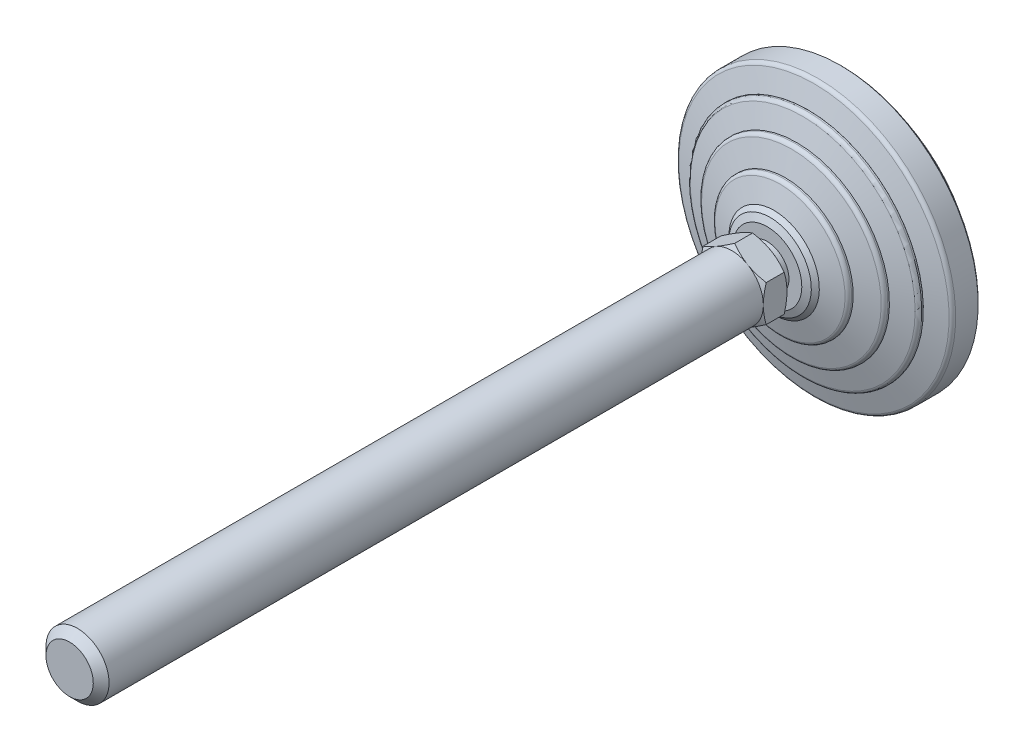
ISO-10303-21;
HEADER;
FILE_DESCRIPTION(('STEP AP214'),'2;1');
FILE_NAME('part.step','',(''),(''),'','','');
FILE_SCHEMA(('AUTOMOTIVE_DESIGN { 1 0 10303 214 1 1 1 1 }'));
ENDSEC;
DATA;
#1=APPLICATION_CONTEXT('core data for automotive mechanical design processes');
#2=APPLICATION_PROTOCOL_DEFINITION('international standard','automotive_design',2000,#1);
#3=PRODUCT_CONTEXT('',#1,'mechanical');
#4=PRODUCT('Part','Part','',(#3));
#5=PRODUCT_RELATED_PRODUCT_CATEGORY('part','',(#4));
#6=PRODUCT_DEFINITION_FORMATION('','',#4);
#7=PRODUCT_DEFINITION_CONTEXT('part definition',#1,'design');
#8=PRODUCT_DEFINITION('design','',#6,#7);
#9=PRODUCT_DEFINITION_SHAPE('','',#8);
#10=(LENGTH_UNIT() NAMED_UNIT(*) SI_UNIT(.MILLI.,.METRE.));
#11=(NAMED_UNIT(*) PLANE_ANGLE_UNIT() SI_UNIT($,.RADIAN.));
#12=(NAMED_UNIT(*) SI_UNIT($,.STERADIAN.) SOLID_ANGLE_UNIT());
#13=UNCERTAINTY_MEASURE_WITH_UNIT(LENGTH_MEASURE(1.E-05),#10,'distance_accuracy_value','');
#14=(GEOMETRIC_REPRESENTATION_CONTEXT(3) GLOBAL_UNCERTAINTY_ASSIGNED_CONTEXT((#13)) GLOBAL_UNIT_ASSIGNED_CONTEXT((#10,
#11,#12)) REPRESENTATION_CONTEXT('',''));
#15=CARTESIAN_POINT('',(0.,0.,0.));
#16=DIRECTION('',(0.,0.,1.));
#17=DIRECTION('',(1.,0.,0.));
#18=AXIS2_PLACEMENT_3D('',#15,#16,#17);
#19=CARTESIAN_POINT('',(0.,0.,22.));
#20=DIRECTION('',(0.,0.,-1.));
#21=DIRECTION('',(0.,1.,0.));
#22=AXIS2_PLACEMENT_3D('',#19,#20,#21);
#23=CONICAL_SURFACE('',#22,8.75409836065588,1.17809724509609);
#24=CARTESIAN_POINT('',(0.,0.,21.2928932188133));
#25=DIRECTION('',(0.,0.,-1.));
#26=DIRECTION('',(0.,1.,0.));
#27=AXIS2_PLACEMENT_3D('',#24,#25,#26);
#28=CIRCLE('',#27,10.4612051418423);
#29=CARTESIAN_POINT('',(0.,10.4612051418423,21.2928932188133));
#30=VERTEX_POINT('',#29);
#31=EDGE_CURVE('E340',#30,#30,#28,.T.);
#32=ORIENTED_EDGE('',*,*,#31,.F.);
#33=EDGE_LOOP('',(#32));
#34=FACE_BOUND('',#33,.T.);
#35=CARTESIAN_POINT('',(0.,0.,22.));
#36=DIRECTION('',(0.,0.,-1.));
#37=DIRECTION('',(0.,1.,0.));
#38=AXIS2_PLACEMENT_3D('',#35,#36,#37);
#39=CIRCLE('',#38,8.75409836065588);
#40=CARTESIAN_POINT('',(0.,8.75409836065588,22.));
#41=VERTEX_POINT('',#40);
#42=EDGE_CURVE('E408',#41,#41,#39,.T.);
#43=ORIENTED_EDGE('',*,*,#42,.T.);
#44=EDGE_LOOP('',(#43));
#45=FACE_BOUND('',#44,.T.);
#46=ADVANCED_FACE('F14',(#34,#45),#23,.T.);
#47=CARTESIAN_POINT('',(0.,0.,21.2928932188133));
#48=DIRECTION('',(0.,0.,-1.));
#49=DIRECTION('',(0.,1.,0.));
#50=AXIS2_PLACEMENT_3D('',#47,#48,#49);
#51=CONICAL_SURFACE('',#50,10.4612051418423,0.785398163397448);
#52=CARTESIAN_POINT('',(0.,0.,20.2786885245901));
#53=DIRECTION('',(0.,0.,-1.));
#54=DIRECTION('',(0.,1.,0.));
#55=AXIS2_PLACEMENT_3D('',#52,#53,#54);
#56=CIRCLE('',#55,11.4754098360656);
#57=CARTESIAN_POINT('',(0.,11.4754098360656,20.2786885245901));
#58=VERTEX_POINT('',#57);
#59=EDGE_CURVE('E337',#58,#58,#56,.T.);
#60=ORIENTED_EDGE('',*,*,#59,.F.);
#61=EDGE_LOOP('',(#60));
#62=FACE_BOUND('',#61,.T.);
#63=ORIENTED_EDGE('',*,*,#31,.T.);
#64=EDGE_LOOP('',(#63));
#65=FACE_BOUND('',#64,.T.);
#66=ADVANCED_FACE('F324',(#62,#65),#51,.T.);
#67=CARTESIAN_POINT('',(0.,0.,20.2786885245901));
#68=DIRECTION('',(0.,0.,-1.));
#69=DIRECTION('',(0.,1.,0.));
#70=AXIS2_PLACEMENT_3D('',#67,#68,#69);
#71=CONICAL_SURFACE('',#70,11.4754098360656,1.27933953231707);
#72=CARTESIAN_POINT('',(0.,0.,18.7711726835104));
#73=DIRECTION('',(0.,0.,-1.));
#74=DIRECTION('',(0.,1.,0.));
#75=AXIS2_PLACEMENT_3D('',#72,#73,#74);
#76=CIRCLE('',#75,16.5004626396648);
#77=CARTESIAN_POINT('',(0.,16.5004626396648,18.7711726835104));
#78=VERTEX_POINT('',#77);
#79=EDGE_CURVE('E346',#78,#78,#76,.T.);
#80=ORIENTED_EDGE('',*,*,#79,.F.);
#81=EDGE_LOOP('',(#80));
#82=FACE_BOUND('',#81,.T.);
#83=ORIENTED_EDGE('',*,*,#59,.T.);
#84=EDGE_LOOP('',(#83));
#85=FACE_BOUND('',#84,.T.);
#86=ADVANCED_FACE('F321',(#82,#85),#71,.T.);
#87=CARTESIAN_POINT('',(0.,0.,17.8133463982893));
#88=DIRECTION('',(0.,0.,-1.));
#89=DIRECTION('',(0.,1.,0.));
#90=AXIS2_PLACEMENT_3D('',#87,#88,#89);
#91=TOROIDAL_SURFACE('',#90,16.2131147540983,1.00000000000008);
#92=CARTESIAN_POINT('',(0.,0.,17.8133463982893));
#93=DIRECTION('',(0.,0.,-1.));
#94=DIRECTION('',(0.,1.,0.));
#95=AXIS2_PLACEMENT_3D('',#92,#93,#94);
#96=CIRCLE('',#95,17.2131147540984);
#97=CARTESIAN_POINT('',(0.,17.2131147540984,17.8133463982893));
#98=VERTEX_POINT('',#97);
#99=EDGE_CURVE('E351',#98,#98,#96,.T.);
#100=ORIENTED_EDGE('',*,*,#99,.F.);
#101=EDGE_LOOP('',(#100));
#102=FACE_BOUND('',#101,.T.);
#103=ORIENTED_EDGE('',*,*,#79,.T.);
#104=EDGE_LOOP('',(#103));
#105=FACE_BOUND('',#104,.T.);
#106=ADVANCED_FACE('F317',(#102,#105),#91,.T.);
#107=CARTESIAN_POINT('',(0.,0.,0.));
#108=DIRECTION('',(0.,0.,-1.));
#109=DIRECTION('',(0.,1.,0.));
#110=AXIS2_PLACEMENT_3D('',#107,#108,#109);
#111=CYLINDRICAL_SURFACE('',#110,17.2131147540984);
#112=CARTESIAN_POINT('',(0.,0.,17.4098360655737));
#113=DIRECTION('',(0.,0.,-1.));
#114=DIRECTION('',(0.,1.,0.));
#115=AXIS2_PLACEMENT_3D('',#112,#113,#114);
#116=CIRCLE('',#115,17.2131147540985);
#117=CARTESIAN_POINT('',(0.,17.2131147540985,17.4098360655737));
#118=VERTEX_POINT('',#117);
#119=EDGE_CURVE('E354',#118,#118,#116,.T.);
#120=ORIENTED_EDGE('',*,*,#119,.F.);
#121=EDGE_LOOP('',(#120));
#122=FACE_BOUND('',#121,.T.);
#123=ORIENTED_EDGE('',*,*,#99,.T.);
#124=EDGE_LOOP('',(#123));
#125=FACE_BOUND('',#124,.T.);
#126=ADVANCED_FACE('F313',(#122,#125),#111,.T.);
#127=CARTESIAN_POINT('',(0.,0.,17.4098360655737));
#128=DIRECTION('',(0.,0.,-1.));
#129=DIRECTION('',(0.,1.,0.));
#130=AXIS2_PLACEMENT_3D('',#127,#128,#129);
#131=CONICAL_SURFACE('',#130,17.2131147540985,1.30454427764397);
#132=CARTESIAN_POINT('',(0.,0.,15.8894925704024));
#133=DIRECTION('',(0.,0.,-1.));
#134=DIRECTION('',(0.,1.,0.));
#135=AXIS2_PLACEMENT_3D('',#132,#133,#134);
#136=CIRCLE('',#135,22.7877075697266);
#137=CARTESIAN_POINT('',(0.,22.7877075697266,15.8894925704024));
#138=VERTEX_POINT('',#137);
#139=EDGE_CURVE('E357',#138,#138,#136,.T.);
#140=ORIENTED_EDGE('',*,*,#139,.F.);
#141=EDGE_LOOP('',(#140));
#142=FACE_BOUND('',#141,.T.);
#143=ORIENTED_EDGE('',*,*,#119,.T.);
#144=EDGE_LOOP('',(#143));
#145=FACE_BOUND('',#144,.T.);
#146=ADVANCED_FACE('F309',(#142,#145),#131,.T.);
#147=CARTESIAN_POINT('',(0.,0.,14.9247287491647));
#148=DIRECTION('',(0.,0.,-1.));
#149=DIRECTION('',(0.,1.,0.));
#150=AXIS2_PLACEMENT_3D('',#147,#148,#149);
#151=TOROIDAL_SURFACE('',#150,22.5245901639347,0.999999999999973);
#152=CARTESIAN_POINT('',(0.,0.,14.9247287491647));
#153=DIRECTION('',(0.,0.,-1.));
#154=DIRECTION('',(0.,1.,0.));
#155=AXIS2_PLACEMENT_3D('',#152,#153,#154);
#156=CIRCLE('',#155,23.5245901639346);
#157=CARTESIAN_POINT('',(0.,23.5245901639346,14.9247287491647));
#158=VERTEX_POINT('',#157);
#159=EDGE_CURVE('E360',#158,#158,#156,.T.);
#160=ORIENTED_EDGE('',*,*,#159,.F.);
#161=EDGE_LOOP('',(#160));
#162=FACE_BOUND('',#161,.T.);
#163=ORIENTED_EDGE('',*,*,#139,.T.);
#164=EDGE_LOOP('',(#163));
#165=FACE_BOUND('',#164,.T.);
#166=ADVANCED_FACE('F305',(#162,#165),#151,.T.);
#167=CARTESIAN_POINT('',(0.,0.,0.));
#168=DIRECTION('',(0.,0.,-1.));
#169=DIRECTION('',(0.,1.,0.));
#170=AXIS2_PLACEMENT_3D('',#167,#168,#169);
#171=CYLINDRICAL_SURFACE('',#170,23.5245901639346);
#172=CARTESIAN_POINT('',(0.,0.,14.5409836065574));
#173=DIRECTION('',(0.,0.,-1.));
#174=DIRECTION('',(0.,1.,0.));
#175=AXIS2_PLACEMENT_3D('',#172,#173,#174);
#176=CIRCLE('',#175,23.5245901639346);
#177=CARTESIAN_POINT('',(0.,23.5245901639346,14.5409836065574));
#178=VERTEX_POINT('',#177);
#179=EDGE_CURVE('E363',#178,#178,#176,.T.);
#180=ORIENTED_EDGE('',*,*,#179,.F.);
#181=EDGE_LOOP('',(#180));
#182=FACE_BOUND('',#181,.T.);
#183=ORIENTED_EDGE('',*,*,#159,.T.);
#184=EDGE_LOOP('',(#183));
#185=FACE_BOUND('',#184,.T.);
#186=ADVANCED_FACE('F301',(#182,#185),#171,.T.);
#187=CARTESIAN_POINT('',(0.,0.,14.5409836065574));
#188=DIRECTION('',(0.,0.,-1.));
#189=DIRECTION('',(0.,1.,0.));
#190=AXIS2_PLACEMENT_3D('',#187,#188,#189);
#191=CONICAL_SURFACE('',#190,23.5245901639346,1.27871257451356);
#192=CARTESIAN_POINT('',(0.,0.,13.0337743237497));
#193=DIRECTION('',(0.,0.,-1.));
#194=DIRECTION('',(0.,1.,0.));
#195=AXIS2_PLACEMENT_3D('',#192,#193,#194);
#196=CIRCLE('',#195,28.5372004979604);
#197=CARTESIAN_POINT('',(0.,28.5372004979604,13.0337743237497));
#198=VERTEX_POINT('',#197);
#199=EDGE_CURVE('E366',#198,#198,#196,.T.);
#200=ORIENTED_EDGE('',*,*,#199,.F.);
#201=EDGE_LOOP('',(#200));
#202=FACE_BOUND('',#201,.T.);
#203=ORIENTED_EDGE('',*,*,#179,.T.);
#204=EDGE_LOOP('',(#203));
#205=FACE_BOUND('',#204,.T.);
#206=ADVANCED_FACE('F297',(#202,#205),#191,.T.);
#207=CARTESIAN_POINT('',(0.,0.,12.0761283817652));
#208=DIRECTION('',(0.,0.,-1.));
#209=DIRECTION('',(0.,1.,0.));
#210=AXIS2_PLACEMENT_3D('',#207,#208,#209);
#211=TOROIDAL_SURFACE('',#210,28.2492521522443,1.00000000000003);
#212=CARTESIAN_POINT('',(0.,0.,12.0761283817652));
#213=DIRECTION('',(0.,0.,-1.));
#214=DIRECTION('',(0.,1.,0.));
#215=AXIS2_PLACEMENT_3D('',#212,#213,#214);
#216=CIRCLE('',#215,29.2492521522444);
#217=CARTESIAN_POINT('',(0.,29.2492521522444,12.0761283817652));
#218=VERTEX_POINT('',#217);
#219=EDGE_CURVE('E369',#218,#218,#216,.T.);
#220=ORIENTED_EDGE('',*,*,#219,.F.);
#221=EDGE_LOOP('',(#220));
#222=FACE_BOUND('',#221,.T.);
#223=ORIENTED_EDGE('',*,*,#199,.T.);
#224=EDGE_LOOP('',(#223));
#225=FACE_BOUND('',#224,.T.);
#226=ADVANCED_FACE('F293',(#222,#225),#211,.T.);
#227=CARTESIAN_POINT('',(0.,0.,0.));
#228=DIRECTION('',(0.,0.,-1.));
#229=DIRECTION('',(0.,1.,0.));
#230=AXIS2_PLACEMENT_3D('',#227,#228,#229);
#231=CYLINDRICAL_SURFACE('',#230,29.2492521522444);
#232=CARTESIAN_POINT('',(0.,0.,11.6721311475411));
#233=DIRECTION('',(0.,0.,-1.));
#234=DIRECTION('',(0.,1.,0.));
#235=AXIS2_PLACEMENT_3D('',#232,#233,#234);
#236=CIRCLE('',#235,29.2492521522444);
#237=CARTESIAN_POINT('',(0.,29.2492521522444,11.6721311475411));
#238=VERTEX_POINT('',#237);
#239=EDGE_CURVE('E372',#238,#238,#236,.T.);
#240=ORIENTED_EDGE('',*,*,#239,.F.);
#241=EDGE_LOOP('',(#240));
#242=FACE_BOUND('',#241,.T.);
#243=ORIENTED_EDGE('',*,*,#219,.T.);
#244=EDGE_LOOP('',(#243));
#245=FACE_BOUND('',#244,.T.);
#246=ADVANCED_FACE('F289',(#242,#245),#231,.T.);
#247=CARTESIAN_POINT('',(-29.2622950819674,0.,11.6721311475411));
#248=DIRECTION('',(0.,0.,-1.));
#249=DIRECTION('',(0.,1.,0.));
#250=AXIS2_PLACEMENT_3D('',#247,#248,#249);
#251=PLANE('',#250);
#252=CARTESIAN_POINT('',(0.,0.,11.6721311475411));
#253=DIRECTION('',(0.,0.,-1.));
#254=DIRECTION('',(0.,1.,0.));
#255=AXIS2_PLACEMENT_3D('',#252,#253,#254);
#256=CIRCLE('',#255,29.2622950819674);
#257=CARTESIAN_POINT('',(0.,29.2622950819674,11.6721311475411));
#258=VERTEX_POINT('',#257);
#259=EDGE_CURVE('E375',#258,#258,#256,.T.);
#260=ORIENTED_EDGE('',*,*,#259,.F.);
#261=EDGE_LOOP('',(#260));
#262=FACE_BOUND('',#261,.T.);
#263=ORIENTED_EDGE('',*,*,#239,.T.);
#264=EDGE_LOOP('',(#263));
#265=FACE_BOUND('',#264,.T.);
#266=ADVANCED_FACE('F285',(#262,#265),#251,.F.);
#267=CARTESIAN_POINT('',(0.,0.,11.6721311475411));
#268=DIRECTION('',(0.,0.,-1.));
#269=DIRECTION('',(0.,1.,0.));
#270=AXIS2_PLACEMENT_3D('',#267,#268,#269);
#271=CONICAL_SURFACE('',#270,29.2622950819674,1.27933953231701);
#272=CARTESIAN_POINT('',(0.,0.,10.1646153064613));
#273=DIRECTION('',(0.,0.,-1.));
#274=DIRECTION('',(0.,1.,0.));
#275=AXIS2_PLACEMENT_3D('',#272,#273,#274);
#276=CIRCLE('',#275,34.2873478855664);
#277=CARTESIAN_POINT('',(0.,34.2873478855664,10.1646153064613));
#278=VERTEX_POINT('',#277);
#279=EDGE_CURVE('E378',#278,#278,#276,.T.);
#280=ORIENTED_EDGE('',*,*,#279,.F.);
#281=EDGE_LOOP('',(#280));
#282=FACE_BOUND('',#281,.T.);
#283=ORIENTED_EDGE('',*,*,#259,.T.);
#284=EDGE_LOOP('',(#283));
#285=FACE_BOUND('',#284,.T.);
#286=ADVANCED_FACE('F281',(#282,#285),#271,.T.);
#287=CARTESIAN_POINT('',(0.,0.,9.20678902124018));
#288=DIRECTION('',(0.,0.,-1.));
#289=DIRECTION('',(0.,1.,0.));
#290=AXIS2_PLACEMENT_3D('',#287,#288,#289);
#291=TOROIDAL_SURFACE('',#290,34.,0.999999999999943);
#292=CARTESIAN_POINT('',(0.,0.,9.20678902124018));
#293=DIRECTION('',(0.,0.,-1.));
#294=DIRECTION('',(0.,1.,0.));
#295=AXIS2_PLACEMENT_3D('',#292,#293,#294);
#296=CIRCLE('',#295,35.);
#297=CARTESIAN_POINT('',(0.,35.,9.20678902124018));
#298=VERTEX_POINT('',#297);
#299=EDGE_CURVE('E381',#298,#298,#296,.T.);
#300=ORIENTED_EDGE('',*,*,#299,.F.);
#301=EDGE_LOOP('',(#300));
#302=FACE_BOUND('',#301,.T.);
#303=ORIENTED_EDGE('',*,*,#279,.T.);
#304=EDGE_LOOP('',(#303));
#305=FACE_BOUND('',#304,.T.);
#306=ADVANCED_FACE('F277',(#302,#305),#291,.T.);
#307=CARTESIAN_POINT('',(0.,0.,0.));
#308=DIRECTION('',(0.,0.,-1.));
#309=DIRECTION('',(0.,1.,0.));
#310=AXIS2_PLACEMENT_3D('',#307,#308,#309);
#311=CYLINDRICAL_SURFACE('',#310,35.);
#312=CARTESIAN_POINT('',(0.,0.,3.5));
#313=DIRECTION('',(0.,0.,-1.));
#314=DIRECTION('',(0.,1.,0.));
#315=AXIS2_PLACEMENT_3D('',#312,#313,#314);
#316=CIRCLE('',#315,35.);
#317=CARTESIAN_POINT('',(0.,35.,3.5));
#318=VERTEX_POINT('',#317);
#319=EDGE_CURVE('E384',#318,#318,#316,.T.);
#320=ORIENTED_EDGE('',*,*,#319,.F.);
#321=EDGE_LOOP('',(#320));
#322=FACE_BOUND('',#321,.T.);
#323=ORIENTED_EDGE('',*,*,#299,.T.);
#324=EDGE_LOOP('',(#323));
#325=FACE_BOUND('',#324,.T.);
#326=ADVANCED_FACE('F273',(#322,#325),#311,.T.);
#327=CARTESIAN_POINT('',(0.,0.,3.5));
#328=DIRECTION('',(0.,0.,1.));
#329=DIRECTION('',(0.,-1.,0.));
#330=AXIS2_PLACEMENT_3D('',#327,#328,#329);
#331=CONICAL_SURFACE('',#330,35.,0.785398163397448);
#332=CARTESIAN_POINT('',(0.,0.,3.));
#333=DIRECTION('',(0.,0.,-1.));
#334=DIRECTION('',(0.,1.,0.));
#335=AXIS2_PLACEMENT_3D('',#332,#333,#334);
#336=CIRCLE('',#335,34.5);
#337=CARTESIAN_POINT('',(0.,34.5,3.));
#338=VERTEX_POINT('',#337);
#339=EDGE_CURVE('E387',#338,#338,#336,.T.);
#340=ORIENTED_EDGE('',*,*,#339,.F.);
#341=EDGE_LOOP('',(#340));
#342=FACE_BOUND('',#341,.T.);
#343=ORIENTED_EDGE('',*,*,#319,.T.);
#344=EDGE_LOOP('',(#343));
#345=FACE_BOUND('',#344,.T.);
#346=ADVANCED_FACE('F269',(#342,#345),#331,.T.);
#347=CARTESIAN_POINT('',(-34.5,0.,3.));
#348=DIRECTION('',(0.,0.,1.));
#349=DIRECTION('',(0.,-1.,0.));
#350=AXIS2_PLACEMENT_3D('',#347,#348,#349);
#351=PLANE('',#350);
#352=CARTESIAN_POINT('',(0.,0.,3.));
#353=DIRECTION('',(0.,0.,-1.));
#354=DIRECTION('',(0.,1.,0.));
#355=AXIS2_PLACEMENT_3D('',#352,#353,#354);
#356=CIRCLE('',#355,30.4098360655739);
#357=CARTESIAN_POINT('',(0.,30.4098360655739,3.));
#358=VERTEX_POINT('',#357);
#359=EDGE_CURVE('E390',#358,#358,#356,.T.);
#360=ORIENTED_EDGE('',*,*,#359,.F.);
#361=EDGE_LOOP('',(#360));
#362=FACE_BOUND('',#361,.T.);
#363=ORIENTED_EDGE('',*,*,#339,.T.);
#364=EDGE_LOOP('',(#363));
#365=FACE_BOUND('',#364,.T.);
#366=ADVANCED_FACE('F265',(#362,#365),#351,.F.);
#367=CARTESIAN_POINT('',(0.,0.,0.));
#368=DIRECTION('',(0.,0.,-1.));
#369=DIRECTION('',(0.,1.,0.));
#370=AXIS2_PLACEMENT_3D('',#367,#368,#369);
#371=CYLINDRICAL_SURFACE('',#370,30.4098360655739);
#372=CARTESIAN_POINT('',(0.,0.,0.));
#373=DIRECTION('',(0.,0.,-1.));
#374=DIRECTION('',(0.,1.,0.));
#375=AXIS2_PLACEMENT_3D('',#372,#373,#374);
#376=CIRCLE('',#375,30.4098360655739);
#377=CARTESIAN_POINT('',(0.,30.4098360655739,0.));
#378=VERTEX_POINT('',#377);
#379=EDGE_CURVE('E393',#378,#378,#376,.T.);
#380=ORIENTED_EDGE('',*,*,#379,.F.);
#381=EDGE_LOOP('',(#380));
#382=FACE_BOUND('',#381,.T.);
#383=ORIENTED_EDGE('',*,*,#359,.T.);
#384=EDGE_LOOP('',(#383));
#385=FACE_BOUND('',#384,.T.);
#386=ADVANCED_FACE('F261',(#382,#385),#371,.T.);
#387=CARTESIAN_POINT('',(-30.4098360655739,0.,0.));
#388=DIRECTION('',(0.,0.,1.));
#389=DIRECTION('',(0.,-1.,0.));
#390=AXIS2_PLACEMENT_3D('',#387,#388,#389);
#391=PLANE('',#390);
#392=ORIENTED_EDGE('',*,*,#379,.T.);
#393=EDGE_LOOP('',(#392));
#394=FACE_BOUND('',#393,.T.);
#395=ADVANCED_FACE('F244',(#394),#391,.F.);
#396=CARTESIAN_POINT('',(-7.76470588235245,0.,24.9999999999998));
#397=DIRECTION('',(0.,0.,1.));
#398=DIRECTION('',(0.,-1.,0.));
#399=AXIS2_PLACEMENT_3D('',#396,#397,#398);
#400=PLANE('',#399);
#401=CARTESIAN_POINT('',(0.,0.,24.9999999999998));
#402=DIRECTION('',(0.,0.,-1.));
#403=DIRECTION('',(0.,1.,0.));
#404=AXIS2_PLACEMENT_3D('',#401,#402,#403);
#405=CIRCLE('',#404,5.50000000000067);
#406=CARTESIAN_POINT('',(0.,5.50000000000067,24.9999999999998));
#407=VERTEX_POINT('',#406);
#408=EDGE_CURVE('E402',#407,#407,#405,.T.);
#409=ORIENTED_EDGE('',*,*,#408,.F.);
#410=EDGE_LOOP('',(#409));
#411=FACE_BOUND('',#410,.T.);
#412=CARTESIAN_POINT('',(0.,0.,24.9999999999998));
#413=DIRECTION('',(0.,0.,-1.));
#414=DIRECTION('',(-1.,0.,0.));
#415=AXIS2_PLACEMENT_3D('',#412,#413,#414);
#416=CIRCLE('',#415,8.00000000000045);
#417=CARTESIAN_POINT('',(4.,6.92820323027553,24.9999999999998));
#418=VERTEX_POINT('',#417);
#419=CARTESIAN_POINT('',(8.,0.,24.9999999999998));
#420=VERTEX_POINT('',#419);
#421=EDGE_CURVE('E505',#418,#420,#416,.T.);
#422=ORIENTED_EDGE('',*,*,#421,.T.);
#423=CARTESIAN_POINT('',(4.,-6.92820323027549,24.9999999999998));
#424=VERTEX_POINT('',#423);
#425=EDGE_CURVE('E140',#420,#424,#416,.T.);
#426=ORIENTED_EDGE('',*,*,#425,.T.);
#427=CARTESIAN_POINT('',(-4.,-6.92820323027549,24.9999999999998));
#428=VERTEX_POINT('',#427);
#429=EDGE_CURVE('E139',#424,#428,#416,.T.);
#430=ORIENTED_EDGE('',*,*,#429,.T.);
#431=CARTESIAN_POINT('',(-8.,0.,24.9999999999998));
#432=VERTEX_POINT('',#431);
#433=EDGE_CURVE('E116',#428,#432,#416,.T.);
#434=ORIENTED_EDGE('',*,*,#433,.T.);
#435=CARTESIAN_POINT('',(-4.,6.92820323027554,24.9999999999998));
#436=VERTEX_POINT('',#435);
#437=EDGE_CURVE('E104',#432,#436,#416,.T.);
#438=ORIENTED_EDGE('',*,*,#437,.T.);
#439=EDGE_CURVE('E33',#436,#418,#416,.T.);
#440=ORIENTED_EDGE('',*,*,#439,.T.);
#441=EDGE_LOOP('',(#422,#426,#430,#434,#438,#440));
#442=FACE_BOUND('',#441,.T.);
#443=ADVANCED_FACE('F137',(#411,#442),#400,.F.);
#444=CARTESIAN_POINT('',(0.,0.,0.));
#445=DIRECTION('',(0.,0.,-1.));
#446=DIRECTION('',(0.,1.,0.));
#447=AXIS2_PLACEMENT_3D('',#444,#445,#446);
#448=CYLINDRICAL_SURFACE('',#447,5.50000000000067);
#449=CARTESIAN_POINT('',(0.,0.,22.));
#450=DIRECTION('',(0.,0.,-1.));
#451=DIRECTION('',(0.,1.,0.));
#452=AXIS2_PLACEMENT_3D('',#449,#450,#451);
#453=CIRCLE('',#452,5.50000000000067);
#454=CARTESIAN_POINT('',(0.,5.50000000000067,22.));
#455=VERTEX_POINT('',#454);
#456=EDGE_CURVE('E405',#455,#455,#453,.T.);
#457=ORIENTED_EDGE('',*,*,#456,.F.);
#458=EDGE_LOOP('',(#457));
#459=FACE_BOUND('',#458,.T.);
#460=ORIENTED_EDGE('',*,*,#408,.T.);
#461=EDGE_LOOP('',(#460));
#462=FACE_BOUND('',#461,.T.);
#463=ADVANCED_FACE('F237',(#459,#462),#448,.T.);
#464=CARTESIAN_POINT('',(-8.75409836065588,0.,22.));
#465=DIRECTION('',(0.,0.,-1.));
#466=DIRECTION('',(0.,1.,0.));
#467=AXIS2_PLACEMENT_3D('',#464,#465,#466);
#468=PLANE('',#467);
#469=ORIENTED_EDGE('',*,*,#42,.F.);
#470=EDGE_LOOP('',(#469));
#471=FACE_BOUND('',#470,.T.);
#472=ORIENTED_EDGE('',*,*,#456,.T.);
#473=EDGE_LOOP('',(#472));
#474=FACE_BOUND('',#473,.T.);
#475=ADVANCED_FACE('F233',(#471,#474),#468,.F.);
#476=CARTESIAN_POINT('',(0.,0.,26.2988330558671));
#477=DIRECTION('',(0.,0.,1.));
#478=DIRECTION('',(1.,0.,0.));
#479=AXIS2_PLACEMENT_3D('',#476,#477,#478);
#480=CONICAL_SURFACE('',#479,10.2496448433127,1.0471975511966);
#481=CARTESIAN_POINT('',(8.,-12.3309736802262,28.8675184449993));
#482=CARTESIAN_POINT('',(8.,-11.982192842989,28.6986342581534));
#483=CARTESIAN_POINT('',(7.99999999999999,-11.6326031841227,28.5313914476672));
#484=CARTESIAN_POINT('',(7.99999999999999,-10.9313757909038,28.2011132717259));
#485=CARTESIAN_POINT('',(7.99999999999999,-10.5797377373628,28.0380785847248));
#486=CARTESIAN_POINT('',(7.99999999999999,-9.8721347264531,27.7163048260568));
#487=CARTESIAN_POINT('',(7.99999999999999,-9.51615658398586,27.5575946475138));
#488=CARTESIAN_POINT('',(7.99999999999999,-8.80134243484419,27.246771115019));
#489=CARTESIAN_POINT('',(7.99999999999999,-8.44250656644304,27.094657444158));
#490=CARTESIAN_POINT('',(7.99999999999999,-7.71011070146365,26.7941363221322));
#491=CARTESIAN_POINT('',(7.99999999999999,-7.33644136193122,26.6459938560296));
#492=CARTESIAN_POINT('',(7.99999999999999,-6.58470400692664,26.3611052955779));
#493=CARTESIAN_POINT('',(8.,-6.20663549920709,26.2243604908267));
#494=CARTESIAN_POINT('',(8.,-5.44622625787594,25.9659132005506));
#495=CARTESIAN_POINT('',(7.99999999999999,-5.06389621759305,25.8441795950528));
#496=CARTESIAN_POINT('',(8.,-4.29376660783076,25.6197090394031));
#497=CARTESIAN_POINT('',(8.,-3.90596882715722,25.516966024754));
#498=CARTESIAN_POINT('',(8.,-3.12676093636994,25.3360074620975));
#499=CARTESIAN_POINT('',(8.,-2.73538195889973,25.2576615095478));
#500=CARTESIAN_POINT('',(8.,-2.1448107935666,25.1618687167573));
#501=CARTESIAN_POINT('',(8.,-1.94735483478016,25.1335574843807));
#502=CARTESIAN_POINT('',(8.,-1.55148742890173,25.084734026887));
#503=CARTESIAN_POINT('',(8.,-1.3530760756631,25.06422105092));
#504=CARTESIAN_POINT('',(8.,-0.958121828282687,25.0316561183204));
#505=CARTESIAN_POINT('',(8.,-0.761587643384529,25.0194989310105));
#506=CARTESIAN_POINT('',(8.,-0.368181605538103,25.003501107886));
#507=CARTESIAN_POINT('',(8.,-0.171309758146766,24.9996603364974));
#508=CARTESIAN_POINT('',(8.,0.222420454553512,25.0003867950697));
#509=CARTESIAN_POINT('',(8.,0.419278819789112,25.0049540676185));
#510=CARTESIAN_POINT('',(8.,0.812630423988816,25.022386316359));
#511=CARTESIAN_POINT('',(8.,1.00912364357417,25.0352517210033));
#512=CARTESIAN_POINT('',(8.,1.48368734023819,25.076075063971));
#513=CARTESIAN_POINT('',(8.,1.7614151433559,25.1080995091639));
#514=CARTESIAN_POINT('',(8.,2.31474618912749,25.1869609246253));
#515=CARTESIAN_POINT('',(8.,2.59034912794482,25.2337999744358));
#516=CARTESIAN_POINT('',(8.,3.41369191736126,25.3940498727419));
#517=CARTESIAN_POINT('',(8.,3.95764440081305,25.5271622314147));
#518=CARTESIAN_POINT('',(8.,4.77087739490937,25.7571865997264));
#519=CARTESIAN_POINT('',(8.,5.04439647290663,25.8399685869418));
#520=CARTESIAN_POINT('',(8.,5.58877685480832,26.0139309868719));
#521=CARTESIAN_POINT('',(8.,5.85963814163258,26.1051114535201));
#522=CARTESIAN_POINT('',(8.,6.39879182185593,26.2944245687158));
#523=CARTESIAN_POINT('',(8.,6.66708507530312,26.3925547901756));
#524=CARTESIAN_POINT('',(8.,7.20146248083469,26.5946328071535));
#525=CARTESIAN_POINT('',(8.,7.46754665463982,26.6985805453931));
#526=CARTESIAN_POINT('',(8.,8.07775815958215,26.9434264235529));
#527=CARTESIAN_POINT('',(8.,8.42120788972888,27.0860097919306));
#528=CARTESIAN_POINT('',(8.,9.10532614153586,27.3777166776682));
#529=CARTESIAN_POINT('',(8.,9.44599451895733,27.5268405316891));
#530=CARTESIAN_POINT('',(8.,10.125045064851,27.83036691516));
#531=CARTESIAN_POINT('',(8.,10.4634267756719,27.9847704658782));
#532=CARTESIAN_POINT('',(8.,11.1382048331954,28.2978323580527));
#533=CARTESIAN_POINT('',(8.,11.4746012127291,28.4564906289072));
#534=CARTESIAN_POINT('',(8.,12.1460332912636,28.7774398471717));
#535=CARTESIAN_POINT('',(8.,12.4810674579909,28.9397339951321));
#536=CARTESIAN_POINT('',(8.,13.1497204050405,29.2672146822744));
#537=CARTESIAN_POINT('',(8.,13.4833391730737,29.4324012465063));
#538=CARTESIAN_POINT('',(8.,14.4824140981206,29.9315622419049));
#539=CARTESIAN_POINT('',(8.,15.1460750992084,30.269131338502));
#540=CARTESIAN_POINT('',(8.,16.1125910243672,30.7670367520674));
#541=CARTESIAN_POINT('',(8.00000000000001,16.4168387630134,30.9246862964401));
#542=CARTESIAN_POINT('',(8.00000000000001,17.0246701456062,31.2412489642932));
#543=CARTESIAN_POINT('',(8.00000000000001,17.3282538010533,31.4001620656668));
#544=CARTESIAN_POINT('',(8.00000000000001,18.2381639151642,31.8785556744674));
#545=CARTESIAN_POINT('',(8.00000000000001,18.843626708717,32.1996787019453));
#546=CARTESIAN_POINT('',(8.00000000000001,20.0513747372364,32.8445424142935));
#547=CARTESIAN_POINT('',(8.00000000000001,20.6536640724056,33.1682754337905));
#548=CARTESIAN_POINT('',(8.00000000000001,21.8567720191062,33.8183913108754));
#549=CARTESIAN_POINT('',(8.00000000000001,22.4575907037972,34.1447740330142));
#550=CARTESIAN_POINT('',(8.,23.0578626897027,34.4721527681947));
#551=B_SPLINE_CURVE_WITH_KNOTS('',3,(#481,#482,#483,#484,#485,#486,#487,#488,#489,#490,#491,
#492,#493,#494,#495,#496,#497,#498,#499,#500,#501,#502,#503,#504,#505,#506,#507,#508,#509,#510,
#511,#512,#513,#514,#515,#516,#517,#518,#519,#520,#521,#522,#523,#524,#525,#526,#527,#528,#529,
#530,#531,#532,#533,#534,#535,#536,#537,#538,#539,#540,#541,#542,#543,#544,#545,#546,#547,#548,
#549,#550),.UNSPECIFIED.,.F.,.F.,(4,2,2,2,2,2,2,2,2,2,2,2,2,2,2,2,2,2,2,2,2,2,2,2,2,2,2,2,2,2,2,
2,2,2,4),(0.,1.16256756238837,2.32532140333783,3.49453435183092,4.66369106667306,
5.86943851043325,7.07532219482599,8.27866234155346,9.48161754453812,10.6780278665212,
11.2763238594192,11.8745622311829,12.4651212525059,13.0556706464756,13.6462230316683,
14.2368059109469,15.0750347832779,15.9133813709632,17.5910387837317,18.4482854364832,
19.3055375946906,20.1624918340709,21.0194376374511,22.1349600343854,23.2505399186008,
24.3663368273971,25.4821152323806,26.598917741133,27.715729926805,29.949400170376,
30.9773975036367,32.0053768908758,34.0614126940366,36.1127467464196,38.163976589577),.UNSPECIFIED.);
#552=CARTESIAN_POINT('',(8.,4.61880215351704,25.7145311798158));
#553=VERTEX_POINT('',#552);
#554=EDGE_CURVE('E114',#553,#420,#551,.F.);
#555=ORIENTED_EDGE('',*,*,#554,.T.);
#556=ORIENTED_EDGE('',*,*,#421,.F.);
#557=CARTESIAN_POINT('',(-1.07577877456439,9.85870547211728,26.106911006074));
#558=CARTESIAN_POINT('',(-0.879083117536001,9.74514318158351,26.0294323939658));
#559=CARTESIAN_POINT('',(-0.681599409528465,9.63112590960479,25.954538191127));
#560=CARTESIAN_POINT('',(-0.284897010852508,9.40208967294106,25.810848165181));
#561=CARTESIAN_POINT('',(-0.0856776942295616,9.28707034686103,25.7420546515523));
#562=CARTESIAN_POINT('',(0.315339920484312,9.05554271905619,25.6112836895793));
#563=CARTESIAN_POINT('',(0.517145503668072,8.93903021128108,25.5493358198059));
#564=CARTESIAN_POINT('',(0.922511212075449,8.70499221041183,25.4336948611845));
#565=CARTESIAN_POINT('',(1.12607114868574,8.58746682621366,25.380000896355));
#566=CARTESIAN_POINT('',(1.52856299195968,8.35508805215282,25.2835260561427));
#567=CARTESIAN_POINT('',(1.72744307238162,8.24026458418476,25.2404587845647));
#568=CARTESIAN_POINT('',(2.12661243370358,8.00980404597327,25.1641785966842));
#569=CARTESIAN_POINT('',(2.32690160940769,7.89416703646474,25.1309649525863));
#570=CARTESIAN_POINT('',(2.72823098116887,7.66245941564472,25.075352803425));
#571=CARTESIAN_POINT('',(2.92926905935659,7.54639002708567,25.0529340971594));
#572=CARTESIAN_POINT('',(3.33205697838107,7.31384031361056,25.0195036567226));
#573=CARTESIAN_POINT('',(3.53380679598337,7.19736000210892,25.0084915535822));
#574=CARTESIAN_POINT('',(3.92547678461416,6.97122922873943,24.998535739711));
#575=CARTESIAN_POINT('',(4.11538408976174,6.8615861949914,24.9989107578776));
#576=CARTESIAN_POINT('',(4.49496895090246,6.6424327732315,25.0100465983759));
#577=CARTESIAN_POINT('',(4.68464650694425,6.53292238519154,25.0208074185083));
#578=CARTESIAN_POINT('',(5.06367154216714,6.314092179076,25.0524329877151));
#579=CARTESIAN_POINT('',(5.25301799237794,6.20477295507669,25.0733140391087));
#580=CARTESIAN_POINT('',(5.63072791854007,5.9867020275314,25.1246170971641));
#581=CARTESIAN_POINT('',(5.81909140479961,5.87795031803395,25.1550390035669));
#582=CARTESIAN_POINT('',(6.3934092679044,5.54636774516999,25.261574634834));
#583=CARTESIAN_POINT('',(6.77737110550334,5.3246872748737,25.3519588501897));
#584=CARTESIAN_POINT('',(7.53797675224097,4.88555139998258,25.5622537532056));
#585=CARTESIAN_POINT('',(7.91463975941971,4.66808491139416,25.6820708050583));
#586=CARTESIAN_POINT('',(8.28781225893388,4.45263366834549,25.8130108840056));
#587=B_SPLINE_CURVE_WITH_KNOTS('',3,(#557,#558,#559,#560,#561,#562,#563,#564,#565,#566,#567,
#568,#569,#570,#571,#572,#573,#574,#575,#576,#577,#578,#579,#580,#581,#582,#583,#584,#585,#586),
.UNSPECIFIED.,.F.,.F.,(4,2,2,2,2,2,2,2,2,2,2,2,2,2,4),(0.,0.71995263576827,1.44017666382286,
2.16340006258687,2.88654665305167,3.5873052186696,4.28801201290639,4.98740238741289,
5.6867701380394,6.34438327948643,7.00199628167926,7.66067214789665,8.31934109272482,
9.67552481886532,11.0274487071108),.UNSPECIFIED.);
#588=EDGE_CURVE('E17',#418,#553,#587,.T.);
#589=ORIENTED_EDGE('',*,*,#588,.T.);
#590=EDGE_LOOP('',(#555,#556,#589));
#591=FACE_BOUND('',#590,.T.);
#592=ADVANCED_FACE('F157',(#591),#480,.T.);
#593=CARTESIAN_POINT('',(-14.4350863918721,0.903503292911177,28.731607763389));
#594=CARTESIAN_POINT('',(-14.1301550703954,1.07955547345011,28.5623011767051));
#595=CARTESIAN_POINT('',(-13.8244779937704,1.25603821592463,28.3947511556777));
#596=CARTESIAN_POINT('',(-13.2112237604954,1.61010071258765,28.0641825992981));
#597=CARTESIAN_POINT('',(-12.9036462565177,1.78768066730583,27.9011649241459));
#598=CARTESIAN_POINT('',(-12.2843673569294,2.14522150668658,27.5797423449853));
#599=CARTESIAN_POINT('',(-11.9726522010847,2.32519033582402,27.4213726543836));
#600=CARTESIAN_POINT('',(-11.3465669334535,2.68666083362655,27.1118210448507));
#601=CARTESIAN_POINT('',(-11.0321969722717,2.86816241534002,26.96063872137));
#602=CARTESIAN_POINT('',(-10.3974748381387,3.23461941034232,26.6661104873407));
#603=CARTESIAN_POINT('',(-10.0770943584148,3.41959116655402,26.5228454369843));
#604=CARTESIAN_POINT('',(-9.43245009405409,3.79177670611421,26.248243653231));
#605=CARTESIAN_POINT('',(-9.10818585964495,3.97899074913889,26.1169083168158));
#606=CARTESIAN_POINT('',(-8.45600874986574,4.35552537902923,25.8699411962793));
#607=CARTESIAN_POINT('',(-8.12810641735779,4.5448398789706,25.7542727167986));
#608=CARTESIAN_POINT('',(-7.46763115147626,4.92616545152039,25.5426214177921));
#609=CARTESIAN_POINT('',(-7.13505984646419,5.11817558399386,25.4466319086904));
#610=CARTESIAN_POINT('',(-6.4678397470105,5.50339528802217,25.2799769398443));
#611=CARTESIAN_POINT('',(-6.13322875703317,5.69658303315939,25.2091153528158));
#612=CARTESIAN_POINT('',(-5.6285786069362,5.98794293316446,25.1246459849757));
#613=CARTESIAN_POINT('',(-5.45988407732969,6.0853387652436,25.1001249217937));
#614=CARTESIAN_POINT('',(-5.12178959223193,6.28053770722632,25.0588431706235));
#615=CARTESIAN_POINT('',(-4.95238970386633,6.37834077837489,25.0420817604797));
#616=CARTESIAN_POINT('',(-4.61405965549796,6.57367572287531,25.0167591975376));
#617=CARTESIAN_POINT('',(-4.44513199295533,6.67120615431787,25.0081537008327));
#618=CARTESIAN_POINT('',(-4.10711368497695,6.86636111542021,24.9991799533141));
#619=CARTESIAN_POINT('',(-3.93802304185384,6.96398564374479,24.9988115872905));
#620=CARTESIAN_POINT('',(-3.60002142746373,7.15913096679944,25.0063206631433));
#621=CARTESIAN_POINT('',(-3.43111042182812,7.25665178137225,25.014196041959));
#622=CARTESIAN_POINT('',(-3.09371234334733,7.4514486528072,25.038006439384));
#623=CARTESIAN_POINT('',(-2.92522529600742,7.54872469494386,25.0539419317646));
#624=CARTESIAN_POINT('',(-2.50903627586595,7.7890115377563,25.1029407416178));
#625=CARTESIAN_POINT('',(-2.26172814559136,7.93179495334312,25.1405444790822));
#626=CARTESIAN_POINT('',(-1.76921397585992,8.21614814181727,25.2309538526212));
#627=CARTESIAN_POINT('',(-1.52400829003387,8.35771771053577,25.2837619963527));
#628=CARTESIAN_POINT('',(-0.791033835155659,8.78090070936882,25.4623211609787));
#629=CARTESIAN_POINT('',(-0.306886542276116,9.06042327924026,25.6080775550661));
#630=CARTESIAN_POINT('',(0.416858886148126,9.47827789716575,25.8569924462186));
#631=CARTESIAN_POINT('',(0.660285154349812,9.61882011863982,25.9461337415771));
#632=CARTESIAN_POINT('',(1.14478768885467,9.89854778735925,26.1327092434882));
#633=CARTESIAN_POINT('',(1.38586375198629,10.0377331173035,26.2301441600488));
#634=CARTESIAN_POINT('',(1.86445595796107,10.3140484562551,26.4312653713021));
#635=CARTESIAN_POINT('',(2.10198461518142,10.4511856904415,26.5349123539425));
#636=CARTESIAN_POINT('',(2.57505998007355,10.7243158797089,26.7478216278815));
#637=CARTESIAN_POINT('',(2.81060731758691,10.8603091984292,26.857082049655));
#638=CARTESIAN_POINT('',(3.04532661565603,10.9958244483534,26.968614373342));
#639=B_SPLINE_CURVE_WITH_KNOTS('',3,(#593,#594,#595,#596,#597,#598,#599,#600,#601,#602,#603,
#604,#605,#606,#607,#608,#609,#610,#611,#612,#613,#614,#615,#616,#617,#618,#619,#620,#621,#622,
#623,#624,#625,#626,#627,#628,#629,#630,#631,#632,#633,#634,#635,#636,#637,#638),.UNSPECIFIED.,
.F.,.F.,(4,2,2,2,2,2,2,2,2,2,2,2,2,2,2,2,2,2,2,2,2,2,4),(0.,1.17210087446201,2.34442270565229,
3.5240743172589,4.70365945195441,5.893646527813,7.08377277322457,8.27106140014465,
9.4579457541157,10.635351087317,11.2242075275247,11.8130091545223,12.398590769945,
12.9841641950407,13.5695911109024,14.1550524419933,15.0186516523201,15.8823933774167,
17.6132749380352,18.4978565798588,19.3825140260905,20.2620672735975,21.1413294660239),.UNSPECIFIED.);
#640=CARTESIAN_POINT('',(0.,9.23760430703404,25.7145311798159));
#641=VERTEX_POINT('',#640);
#642=EDGE_CURVE('E149',#436,#641,#639,.T.);
#643=ORIENTED_EDGE('',*,*,#642,.T.);
#644=EDGE_CURVE('E9',#641,#418,#587,.T.);
#645=ORIENTED_EDGE('',*,*,#644,.T.);
#646=ORIENTED_EDGE('',*,*,#439,.F.);
#647=EDGE_LOOP('',(#643,#645,#646));
#648=FACE_BOUND('',#647,.T.);
#649=ADVANCED_FACE('F498',(#648),#480,.T.);
#650=CARTESIAN_POINT('',(-6.43987189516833,-12.9556660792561,28.734265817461));
#651=CARTESIAN_POINT('',(-6.13497138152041,-12.7796316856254,28.564952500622));
#652=CARTESIAN_POINT('',(-5.82932590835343,-12.6031671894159,28.3973936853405));
#653=CARTESIAN_POINT('',(-5.21613707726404,-12.2491424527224,28.0668017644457));
#654=CARTESIAN_POINT('',(-4.90859337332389,-12.0715820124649,27.9037695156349));
#655=CARTESIAN_POINT('',(-4.28938975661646,-11.7140846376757,27.5823126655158));
#656=CARTESIAN_POINT('',(-3.97771613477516,-11.5341397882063,27.4239231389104));
#657=CARTESIAN_POINT('',(-3.35171702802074,-11.1727190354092,27.1143213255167));
#658=CARTESIAN_POINT('',(-3.03739169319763,-10.991243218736,26.9631086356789));
#659=CARTESIAN_POINT('',(-2.40273054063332,-10.6248214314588,26.668490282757));
#660=CARTESIAN_POINT('',(-2.08236611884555,-10.4398589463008,26.5251662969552));
#661=CARTESIAN_POINT('',(-1.43775725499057,-10.0676938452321,26.2504303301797));
#662=CARTESIAN_POINT('',(-1.11351236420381,-9.88049097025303,26.119019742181));
#663=CARTESIAN_POINT('',(-0.461374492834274,-9.50397899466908,25.8718805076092));
#664=CARTESIAN_POINT('',(-0.133492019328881,-9.31467596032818,25.7561153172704));
#665=CARTESIAN_POINT('',(0.526942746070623,-8.93337377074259,25.5442454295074));
#666=CARTESIAN_POINT('',(0.859493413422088,-8.74137555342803,25.448134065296));
#667=CARTESIAN_POINT('',(1.52676242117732,-8.35612761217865,25.281187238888));
#668=CARTESIAN_POINT('',(1.86144416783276,-8.16289901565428,25.2101622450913));
#669=CARTESIAN_POINT('',(2.36620734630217,-7.87147385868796,25.1254427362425));
#670=CARTESIAN_POINT('',(2.53494064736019,-7.77405564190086,25.1008374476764));
#671=CARTESIAN_POINT('',(2.87311539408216,-7.57881036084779,25.0593871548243));
#672=CARTESIAN_POINT('',(3.04255677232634,-7.48098333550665,25.042541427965));
#673=CARTESIAN_POINT('',(3.38096842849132,-7.28560127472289,25.0170526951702));
#674=CARTESIAN_POINT('',(3.54993618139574,-7.18804769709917,25.0083651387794));
#675=CARTESIAN_POINT('',(3.88803765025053,-6.99284472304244,24.9992304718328));
#676=CARTESIAN_POINT('',(4.05717136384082,-6.89519532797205,24.9987832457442));
#677=CARTESIAN_POINT('',(4.39526173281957,-6.69999876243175,25.0061396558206));
#678=CARTESIAN_POINT('',(4.56421842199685,-6.60245157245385,25.0139412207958));
#679=CARTESIAN_POINT('',(4.90171015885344,-6.40760062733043,25.0376105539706));
#680=CARTESIAN_POINT('',(5.07024518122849,-6.31029688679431,25.0534787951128));
#681=CARTESIAN_POINT('',(5.48631386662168,-6.07007951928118,25.1022923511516));
#682=CARTESIAN_POINT('',(5.7334561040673,-5.92739188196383,25.1397662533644));
#683=CARTESIAN_POINT('',(6.22564463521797,-5.64322670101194,25.2299062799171));
#684=CARTESIAN_POINT('',(6.47069057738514,-5.5017493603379,25.2825749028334));
#685=CARTESIAN_POINT('',(7.20319221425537,-5.07883934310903,25.4607086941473));
#686=CARTESIAN_POINT('',(7.68703408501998,-4.79949310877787,25.6061730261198));
#687=CARTESIAN_POINT('',(8.41033637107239,-4.38189433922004,25.8546559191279));
#688=CARTESIAN_POINT('',(8.65362135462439,-4.2414336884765,25.9436550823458));
#689=CARTESIAN_POINT('',(9.13784256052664,-3.96186844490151,26.129949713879));
#690=CARTESIAN_POINT('',(9.37877857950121,-3.82276396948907,26.2272458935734));
#691=CARTESIAN_POINT('',(9.85709282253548,-3.546609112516,26.4280945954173));
#692=CARTESIAN_POINT('',(10.0944835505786,-3.40955151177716,26.5316078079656));
#693=CARTESIAN_POINT('',(10.5672830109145,-3.13658061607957,26.7442532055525));
#694=CARTESIAN_POINT('',(10.8026923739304,-3.00066695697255,26.8533835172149));
#695=CARTESIAN_POINT('',(11.0372734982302,-2.86523148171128,26.9647874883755));
#696=B_SPLINE_CURVE_WITH_KNOTS('',3,(#650,#651,#652,#653,#654,#655,#656,#657,#658,#659,#660,
#661,#662,#663,#664,#665,#666,#667,#668,#669,#670,#671,#672,#673,#674,#675,#676,#677,#678,#679,
#680,#681,#682,#683,#684,#685,#686,#687,#688,#689,#690,#691,#692,#693,#694,#695),.UNSPECIFIED.,
.F.,.F.,(4,2,2,2,2,2,2,2,2,2,2,2,2,2,2,2,2,2,2,2,2,2,4),(0.,1.17201339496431,2.34424714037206,
3.52379119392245,4.70326892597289,5.89326840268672,7.08340684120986,8.27071550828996,
9.45762075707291,10.6353566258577,11.2243779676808,11.813344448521,12.3990756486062,
12.9847986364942,13.5703745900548,14.1559848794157,15.0189640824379,15.882085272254,
17.6117213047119,18.4957073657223,19.3797692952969,20.2587336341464,21.137406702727),.UNSPECIFIED.);
#697=CARTESIAN_POINT('',(8.,-4.61880215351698,25.7145311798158));
#698=VERTEX_POINT('',#697);
#699=EDGE_CURVE('E134',#698,#424,#696,.F.);
#700=ORIENTED_EDGE('',*,*,#699,.T.);
#701=ORIENTED_EDGE('',*,*,#425,.F.);
#702=EDGE_CURVE('E150',#420,#698,#551,.F.);
#703=ORIENTED_EDGE('',*,*,#702,.T.);
#704=EDGE_LOOP('',(#700,#701,#703));
#705=FACE_BOUND('',#704,.T.);
#706=ADVANCED_FACE('F492',(#705),#480,.T.);
#707=CARTESIAN_POINT('',(0.294190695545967,-9.40745538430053,25.8152498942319));
#708=CARTESIAN_POINT('',(-0.0791228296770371,-9.1919227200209,25.6841211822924));
#709=CARTESIAN_POINT('',(-0.455927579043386,-8.97437439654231,25.5641048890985));
#710=CARTESIAN_POINT('',(-1.21682828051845,-8.5350681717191,25.353399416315));
#711=CARTESIAN_POINT('',(-1.60094351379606,-8.31329913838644,25.2628041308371));
#712=CARTESIAN_POINT('',(-2.17549526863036,-7.98158152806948,25.1559565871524));
#713=CARTESIAN_POINT('',(-2.36393404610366,-7.87278634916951,25.125433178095));
#714=CARTESIAN_POINT('',(-2.74179823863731,-7.65462635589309,25.0739296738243));
#715=CARTESIAN_POINT('',(-2.93122366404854,-7.54526153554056,25.0529496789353));
#716=CARTESIAN_POINT('',(-3.31040991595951,-7.32633825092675,25.0211316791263));
#717=CARTESIAN_POINT('',(-3.50016970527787,-7.21678038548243,25.0102773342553));
#718=CARTESIAN_POINT('',(-3.87992279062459,-6.99752983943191,24.998962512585));
#719=CARTESIAN_POINT('',(-4.06991608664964,-6.88783715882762,24.9985020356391));
#720=CARTESIAN_POINT('',(-4.46155458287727,-6.66172456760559,25.008287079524));
#721=CARTESIAN_POINT('',(-4.66318735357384,-6.54531183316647,25.0192021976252));
#722=CARTESIAN_POINT('',(-5.06574567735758,-6.3128946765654,25.0524292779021));
#723=CARTESIAN_POINT('',(-5.26667120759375,-6.19689026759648,25.0747416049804));
#724=CARTESIAN_POINT('',(-5.66777923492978,-5.9653104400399,25.1301349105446));
#725=CARTESIAN_POINT('',(-5.86795962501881,-5.84973623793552,25.1632360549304));
#726=CARTESIAN_POINT('',(-6.26691525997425,-5.61939909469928,25.239288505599));
#727=CARTESIAN_POINT('',(-6.46569040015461,-5.50463621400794,25.2822405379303));
#728=CARTESIAN_POINT('',(-6.86796855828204,-5.27238081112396,25.3784800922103));
#729=CARTESIAN_POINT('',(-7.07141988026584,-5.15491813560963,25.4320538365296));
#730=CARTESIAN_POINT('',(-7.47657081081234,-4.92100413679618,25.5474556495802));
#731=CARTESIAN_POINT('',(-7.67827023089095,-4.8045529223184,25.60928459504));
#732=CARTESIAN_POINT('',(-8.07907928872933,-4.57314570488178,25.739821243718));
#733=CARTESIAN_POINT('',(-8.27819618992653,-4.45818550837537,25.8084994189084));
#734=CARTESIAN_POINT('',(-8.67469472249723,-4.22926697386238,25.9519618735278));
#735=CARTESIAN_POINT('',(-8.87207697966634,-4.11530827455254,26.0267438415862));
#736=CARTESIAN_POINT('',(-9.06867134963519,-4.00180446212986,26.1041119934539));
#737=B_SPLINE_CURVE_WITH_KNOTS('',3,(#707,#708,#709,#710,#711,#712,#713,#714,#715,#716,#717,
#718,#719,#720,#721,#722,#723,#724,#725,#726,#727,#728,#729,#730,#731,#732,#733,#734,#735,#736),
.UNSPECIFIED.,.F.,.F.,(4,2,2,2,2,2,2,2,2,2,2,2,2,2,4),(0.,1.35255684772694,2.70938876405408,
3.36835823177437,4.02733462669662,4.68524577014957,5.34315690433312,6.04210641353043,
6.74107830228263,7.44136423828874,8.14170180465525,8.86440122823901,9.58717746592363,
10.3069623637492,11.0264759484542),.UNSPECIFIED.);
#738=CARTESIAN_POINT('',(0.,-9.23760430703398,25.7145311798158));
#739=VERTEX_POINT('',#738);
#740=EDGE_CURVE('E443',#739,#428,#737,.T.);
#741=ORIENTED_EDGE('',*,*,#740,.T.);
#742=ORIENTED_EDGE('',*,*,#429,.F.);
#743=EDGE_CURVE('E127',#424,#739,#696,.F.);
#744=ORIENTED_EDGE('',*,*,#743,.T.);
#745=EDGE_LOOP('',(#741,#742,#744));
#746=FACE_BOUND('',#745,.T.);
#747=ADVANCED_FACE('F486',(#746),#480,.T.);
#748=CARTESIAN_POINT('',(-8.,-4.61880215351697,25.7145311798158));
#749=VERTEX_POINT('',#748);
#750=EDGE_CURVE('E123',#428,#749,#737,.T.);
#751=ORIENTED_EDGE('',*,*,#750,.T.);
#752=CARTESIAN_POINT('',(-8.,-12.3309736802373,28.8675184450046));
#753=CARTESIAN_POINT('',(-8.,-11.9821928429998,28.6986342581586));
#754=CARTESIAN_POINT('',(-8.,-11.632603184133,28.5313914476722));
#755=CARTESIAN_POINT('',(-8.,-10.9313757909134,28.2011132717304));
#756=CARTESIAN_POINT('',(-8.,-10.5797377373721,28.0380785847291));
#757=CARTESIAN_POINT('',(-8.,-9.8721347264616,27.7163048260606));
#758=CARTESIAN_POINT('',(-8.,-9.51615658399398,27.5575946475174));
#759=CARTESIAN_POINT('',(-8.,-8.80134243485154,27.2467711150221));
#760=CARTESIAN_POINT('',(-8.,-8.44250656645,27.0946574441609));
#761=CARTESIAN_POINT('',(-8.,-7.71011070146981,26.7941363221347));
#762=CARTESIAN_POINT('',(-8.,-7.33644136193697,26.6459938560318));
#763=CARTESIAN_POINT('',(-8.,-6.58470400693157,26.3611052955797));
#764=CARTESIAN_POINT('',(-8.,-6.20663549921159,26.2243604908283));
#765=CARTESIAN_POINT('',(-8.,-5.4462262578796,25.9659132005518));
#766=CARTESIAN_POINT('',(-8.,-5.06389621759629,25.8441795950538));
#767=CARTESIAN_POINT('',(-8.,-4.29376660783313,25.6197090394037));
#768=CARTESIAN_POINT('',(-8.,-3.90596882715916,25.5169660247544));
#769=CARTESIAN_POINT('',(-8.,-3.12676093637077,25.3360074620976));
#770=CARTESIAN_POINT('',(-8.,-2.73538195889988,25.2576615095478));
#771=CARTESIAN_POINT('',(-8.,-2.14481079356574,25.1618687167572));
#772=CARTESIAN_POINT('',(-8.,-1.94735483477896,25.1335574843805));
#773=CARTESIAN_POINT('',(-8.,-1.55148742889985,25.0847340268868));
#774=CARTESIAN_POINT('',(-8.,-1.35307607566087,25.0642210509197));
#775=CARTESIAN_POINT('',(-8.,-0.958121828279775,25.0316561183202));
#776=CARTESIAN_POINT('',(-8.,-0.761587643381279,25.0194989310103));
#777=CARTESIAN_POINT('',(-8.,-0.36818160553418,25.0035011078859));
#778=CARTESIAN_POINT('',(-8.,-0.171309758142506,24.9996603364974));
#779=CARTESIAN_POINT('',(-8.,0.222420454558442,25.0003867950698));
#780=CARTESIAN_POINT('',(-8.,0.419278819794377,25.0049540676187));
#781=CARTESIAN_POINT('',(-8.,0.812630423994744,25.0223863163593));
#782=CARTESIAN_POINT('',(-8.,1.00912364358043,25.0352517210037));
#783=CARTESIAN_POINT('',(-8.,1.48368734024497,25.0760750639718));
#784=CARTESIAN_POINT('',(-8.,1.76141514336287,25.1080995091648));
#785=CARTESIAN_POINT('',(-8.,2.31474618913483,25.1869609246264));
#786=CARTESIAN_POINT('',(-8.,2.59034912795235,25.2337999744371));
#787=CARTESIAN_POINT('',(-8.,3.41369191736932,25.3940498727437));
#788=CARTESIAN_POINT('',(-8.,3.95764440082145,25.5271622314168));
#789=CARTESIAN_POINT('',(-8.,4.77087739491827,25.7571865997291));
#790=CARTESIAN_POINT('',(-8.,5.04439647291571,25.8399685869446));
#791=CARTESIAN_POINT('',(-8.,5.58877685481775,26.013930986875));
#792=CARTESIAN_POINT('',(-8.,5.85963814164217,26.1051114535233));
#793=CARTESIAN_POINT('',(-8.,6.39879182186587,26.2944245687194));
#794=CARTESIAN_POINT('',(-8.,6.66708507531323,26.3925547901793));
#795=CARTESIAN_POINT('',(-8.,7.20146248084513,26.5946328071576));
#796=CARTESIAN_POINT('',(-8.,7.46754665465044,26.6985805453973));
#797=CARTESIAN_POINT('',(-8.,8.07775815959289,26.9434264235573));
#798=CARTESIAN_POINT('',(-8.,8.42120788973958,27.0860097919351));
#799=CARTESIAN_POINT('',(-8.,9.10532614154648,27.3777166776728));
#800=CARTESIAN_POINT('',(-8.,9.4459945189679,27.5268405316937));
#801=CARTESIAN_POINT('',(-8.,10.1250450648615,27.8303669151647));
#802=CARTESIAN_POINT('',(-8.,10.4634267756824,27.984770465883));
#803=CARTESIAN_POINT('',(-8.,11.1382048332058,28.2978323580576));
#804=CARTESIAN_POINT('',(-8.,11.4746012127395,28.4564906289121));
#805=CARTESIAN_POINT('',(-8.,12.1460332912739,28.7774398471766));
#806=CARTESIAN_POINT('',(-8.,12.4810674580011,28.9397339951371));
#807=CARTESIAN_POINT('',(-8.,13.1497204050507,29.2672146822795));
#808=CARTESIAN_POINT('',(-8.,13.4833391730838,29.4324012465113));
#809=CARTESIAN_POINT('',(-8.,14.4824140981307,29.93156224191));
#810=CARTESIAN_POINT('',(-8.,15.1460750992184,30.2691313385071));
#811=CARTESIAN_POINT('',(-8.,16.1125910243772,30.7670367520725));
#812=CARTESIAN_POINT('',(-8.,16.4168387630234,30.9246862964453));
#813=CARTESIAN_POINT('',(-8.,17.0246701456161,31.2412489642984));
#814=CARTESIAN_POINT('',(-8.,17.3282538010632,31.4001620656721));
#815=CARTESIAN_POINT('',(-8.,18.2381639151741,31.8785556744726));
#816=CARTESIAN_POINT('',(-7.99999999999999,18.843626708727,32.1996787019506));
#817=CARTESIAN_POINT('',(-7.99999999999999,20.0513747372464,32.8445424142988));
#818=CARTESIAN_POINT('',(-7.99999999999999,20.6536640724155,33.1682754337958));
#819=CARTESIAN_POINT('',(-7.99999999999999,21.8567720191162,33.8183913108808));
#820=CARTESIAN_POINT('',(-8.,22.4575907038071,34.1447740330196));
#821=CARTESIAN_POINT('',(-8.,23.0578626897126,34.4721527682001));
#822=B_SPLINE_CURVE_WITH_KNOTS('',3,(#752,#753,#754,#755,#756,#757,#758,#759,#760,#761,#762,
#763,#764,#765,#766,#767,#768,#769,#770,#771,#772,#773,#774,#775,#776,#777,#778,#779,#780,#781,
#782,#783,#784,#785,#786,#787,#788,#789,#790,#791,#792,#793,#794,#795,#796,#797,#798,#799,#800,
#801,#802,#803,#804,#805,#806,#807,#808,#809,#810,#811,#812,#813,#814,#815,#816,#817,#818,#819,
#820,#821),.UNSPECIFIED.,.F.,.F.,(4,2,2,2,2,2,2,2,2,2,2,2,2,2,2,2,2,2,2,2,2,2,2,2,2,2,2,2,2,2,2,
2,2,2,4),(0.,1.16256756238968,2.32532140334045,3.49453435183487,4.66369106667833,
5.86943851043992,7.07532219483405,8.27866234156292,9.48161754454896,10.6780278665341,
11.2763238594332,11.8745622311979,12.4651212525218,13.0556706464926,13.6462230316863,
14.2368059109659,15.0750347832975,15.9133813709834,17.5910387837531,18.4482854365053,
19.3055375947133,20.1624918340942,21.0194376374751,22.1349600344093,23.2505399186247,
24.366336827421,25.4821152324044,26.5989177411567,27.7157299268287,29.9494001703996,
30.9773975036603,32.0053768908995,34.0614126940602,36.1127467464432,38.1639765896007),.UNSPECIFIED.);
#823=EDGE_CURVE('E119',#749,#432,#822,.T.);
#824=ORIENTED_EDGE('',*,*,#823,.T.);
#825=ORIENTED_EDGE('',*,*,#433,.F.);
#826=EDGE_LOOP('',(#751,#824,#825));
#827=FACE_BOUND('',#826,.T.);
#828=ADVANCED_FACE('F120',(#827),#480,.T.);
#829=CARTESIAN_POINT('',(-8.,4.61880215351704,25.7145311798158));
#830=VERTEX_POINT('',#829);
#831=EDGE_CURVE('E108',#432,#830,#822,.T.);
#832=ORIENTED_EDGE('',*,*,#831,.T.);
#833=EDGE_CURVE('E110',#830,#436,#639,.T.);
#834=ORIENTED_EDGE('',*,*,#833,.T.);
#835=ORIENTED_EDGE('',*,*,#437,.F.);
#836=EDGE_LOOP('',(#832,#834,#835));
#837=FACE_BOUND('',#836,.T.);
#838=ADVANCED_FACE('F106',(#837),#480,.T.);
#839=CARTESIAN_POINT('',(-6.00000000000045,0.,199.));
#840=DIRECTION('',(0.,0.,-1.));
#841=DIRECTION('',(0.,1.,0.));
#842=AXIS2_PLACEMENT_3D('',#839,#840,#841);
#843=PLANE('',#842);
#844=CARTESIAN_POINT('',(0.,0.,199.));
#845=DIRECTION('',(0.,0.,-1.));
#846=DIRECTION('',(0.,1.,0.));
#847=AXIS2_PLACEMENT_3D('',#844,#845,#846);
#848=CIRCLE('',#847,6.00000000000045);
#849=CARTESIAN_POINT('',(0.,6.00000000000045,199.));
#850=VERTEX_POINT('',#849);
#851=EDGE_CURVE('E396',#850,#850,#848,.T.);
#852=ORIENTED_EDGE('',*,*,#851,.F.);
#853=EDGE_LOOP('',(#852));
#854=FACE_BOUND('',#853,.T.);
#855=ADVANCED_FACE('F254',(#854),#843,.F.);
#856=CARTESIAN_POINT('',(0.,0.,199.));
#857=DIRECTION('',(0.,0.,-1.));
#858=DIRECTION('',(0.,1.,0.));
#859=AXIS2_PLACEMENT_3D('',#856,#857,#858);
#860=CONICAL_SURFACE('',#859,6.00000000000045,0.785398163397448);
#861=CARTESIAN_POINT('',(0.,0.,197.));
#862=DIRECTION('',(0.,0.,-1.));
#863=DIRECTION('',(0.,1.,0.));
#864=AXIS2_PLACEMENT_3D('',#861,#862,#863);
#865=CIRCLE('',#864,8.00000000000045);
#866=CARTESIAN_POINT('',(0.,8.00000000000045,197.));
#867=VERTEX_POINT('',#866);
#868=EDGE_CURVE('E399',#867,#867,#865,.T.);
#869=ORIENTED_EDGE('',*,*,#868,.F.);
#870=EDGE_LOOP('',(#869));
#871=FACE_BOUND('',#870,.T.);
#872=ORIENTED_EDGE('',*,*,#851,.T.);
#873=EDGE_LOOP('',(#872));
#874=FACE_BOUND('',#873,.T.);
#875=ADVANCED_FACE('F250',(#871,#874),#860,.T.);
#876=CARTESIAN_POINT('',(0.,0.,0.));
#877=DIRECTION('',(0.,0.,-1.));
#878=DIRECTION('',(0.,1.,0.));
#879=AXIS2_PLACEMENT_3D('',#876,#877,#878);
#880=CYLINDRICAL_SURFACE('',#879,8.00000000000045);
#881=CARTESIAN_POINT('',(0.,0.,31.));
#882=DIRECTION('',(0.,0.,1.));
#883=DIRECTION('',(0.,-1.,0.));
#884=AXIS2_PLACEMENT_3D('',#881,#882,#883);
#885=CIRCLE('',#884,8.00000000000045);
#886=CARTESIAN_POINT('',(-4.00000000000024,-6.92820323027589,31.));
#887=VERTEX_POINT('',#886);
#888=CARTESIAN_POINT('',(4.00000000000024,-6.92820323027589,31.));
#889=VERTEX_POINT('',#888);
#890=EDGE_CURVE('E341',#887,#889,#885,.T.);
#891=ORIENTED_EDGE('',*,*,#890,.T.);
#892=CARTESIAN_POINT('',(8.00000000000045,0.,31.));
#893=VERTEX_POINT('',#892);
#894=EDGE_CURVE('E345',#889,#893,#885,.T.);
#895=ORIENTED_EDGE('',*,*,#894,.T.);
#896=CARTESIAN_POINT('',(4.,6.92820323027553,31.));
#897=VERTEX_POINT('',#896);
#898=EDGE_CURVE('E514',#893,#897,#885,.T.);
#899=ORIENTED_EDGE('',*,*,#898,.T.);
#900=CARTESIAN_POINT('',(-4.00000000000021,6.92820323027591,31.));
#901=VERTEX_POINT('',#900);
#902=EDGE_CURVE('E435',#897,#901,#885,.T.);
#903=ORIENTED_EDGE('',*,*,#902,.T.);
#904=CARTESIAN_POINT('',(0.,0.,31.));
#905=DIRECTION('',(0.,0.,-1.));
#906=DIRECTION('',(-1.,0.,0.));
#907=AXIS2_PLACEMENT_3D('',#904,#905,#906);
#908=CIRCLE('',#907,8.00000000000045);
#909=CARTESIAN_POINT('',(-8.00000000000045,0.,31.));
#910=VERTEX_POINT('',#909);
#911=EDGE_CURVE('E438',#910,#901,#908,.T.);
#912=ORIENTED_EDGE('',*,*,#911,.F.);
#913=EDGE_CURVE('E344',#910,#887,#885,.T.);
#914=ORIENTED_EDGE('',*,*,#913,.T.);
#915=EDGE_LOOP('',(#891,#895,#899,#903,#912,#914));
#916=FACE_BOUND('',#915,.T.);
#917=ORIENTED_EDGE('',*,*,#868,.T.);
#918=EDGE_LOOP('',(#917));
#919=FACE_BOUND('',#918,.T.);
#920=ADVANCED_FACE('F246',(#916,#919),#880,.T.);
#921=CARTESIAN_POINT('',(0.,0.,31.));
#922=DIRECTION('',(0.,0.,-1.));
#923=DIRECTION('',(-1.,0.,0.));
#924=AXIS2_PLACEMENT_3D('',#921,#922,#923);
#925=CONICAL_SURFACE('',#924,8.00000000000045,1.0471975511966);
#926=CARTESIAN_POINT('',(-14.4350863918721,0.903503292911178,27.2683922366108));
#927=CARTESIAN_POINT('',(-14.1301550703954,1.07955547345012,27.4376988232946));
#928=CARTESIAN_POINT('',(-13.8244779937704,1.25603821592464,27.605248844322));
#929=CARTESIAN_POINT('',(-13.2112237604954,1.61010071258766,27.9358174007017));
#930=CARTESIAN_POINT('',(-12.9036462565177,1.78768066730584,28.0988350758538));
#931=CARTESIAN_POINT('',(-12.2843673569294,2.14522150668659,28.4202576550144));
#932=CARTESIAN_POINT('',(-11.9726522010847,2.32519033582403,28.5786273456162));
#933=CARTESIAN_POINT('',(-11.3465669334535,2.68666083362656,28.888178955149));
#934=CARTESIAN_POINT('',(-11.0321969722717,2.86816241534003,29.0393612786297));
#935=CARTESIAN_POINT('',(-10.3974748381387,3.23461941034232,29.3338895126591));
#936=CARTESIAN_POINT('',(-10.0770943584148,3.41959116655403,29.4771545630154));
#937=CARTESIAN_POINT('',(-9.43245009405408,3.79177670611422,29.7517563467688));
#938=CARTESIAN_POINT('',(-9.10818585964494,3.9789907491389,29.883091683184));
#939=CARTESIAN_POINT('',(-8.45600874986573,4.35552537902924,30.1300588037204));
#940=CARTESIAN_POINT('',(-8.12810641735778,4.54483987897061,30.2457272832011));
#941=CARTESIAN_POINT('',(-7.46763115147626,4.92616545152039,30.4573785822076));
#942=CARTESIAN_POINT('',(-7.13505984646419,5.11817558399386,30.5533680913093));
#943=CARTESIAN_POINT('',(-6.4678397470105,5.50339528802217,30.7200230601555));
#944=CARTESIAN_POINT('',(-6.13322875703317,5.69658303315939,30.790884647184));
#945=CARTESIAN_POINT('',(-5.6285786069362,5.98794293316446,30.875354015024));
#946=CARTESIAN_POINT('',(-5.45988407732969,6.0853387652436,30.899875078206));
#947=CARTESIAN_POINT('',(-5.12178959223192,6.28053770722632,30.9411568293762));
#948=CARTESIAN_POINT('',(-4.95238970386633,6.37834077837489,30.95791823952));
#949=CARTESIAN_POINT('',(-4.61405965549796,6.57367572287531,30.9832408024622));
#950=CARTESIAN_POINT('',(-4.44513199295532,6.67120615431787,30.991846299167));
#951=CARTESIAN_POINT('',(-4.10711368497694,6.86636111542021,31.0008200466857));
#952=CARTESIAN_POINT('',(-3.93802304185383,6.96398564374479,31.0011884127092));
#953=CARTESIAN_POINT('',(-3.60002142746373,7.15913096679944,30.9936793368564));
#954=CARTESIAN_POINT('',(-3.43111042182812,7.25665178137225,30.9858039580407));
#955=CARTESIAN_POINT('',(-3.09371234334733,7.4514486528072,30.9619935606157));
#956=CARTESIAN_POINT('',(-2.92522529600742,7.54872469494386,30.9460580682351));
#957=CARTESIAN_POINT('',(-2.50903627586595,7.7890115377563,30.897059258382));
#958=CARTESIAN_POINT('',(-2.26172814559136,7.93179495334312,30.8594555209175));
#959=CARTESIAN_POINT('',(-1.76921397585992,8.21614814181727,30.7690461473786));
#960=CARTESIAN_POINT('',(-1.52400829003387,8.35771771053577,30.716238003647));
#961=CARTESIAN_POINT('',(-0.791033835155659,8.78090070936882,30.537678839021));
#962=CARTESIAN_POINT('',(-0.306886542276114,9.06042327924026,30.3919224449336));
#963=CARTESIAN_POINT('',(0.416858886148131,9.47827789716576,30.1430075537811));
#964=CARTESIAN_POINT('',(0.660285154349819,9.61882011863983,30.0538662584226));
#965=CARTESIAN_POINT('',(1.14478768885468,9.89854778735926,29.8672907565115));
#966=CARTESIAN_POINT('',(1.3858637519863,10.0377331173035,29.7698558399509));
#967=CARTESIAN_POINT('',(1.86445595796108,10.3140484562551,29.5687346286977));
#968=CARTESIAN_POINT('',(2.10198461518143,10.4511856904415,29.4650876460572));
#969=CARTESIAN_POINT('',(2.57505998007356,10.7243158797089,29.2521783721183));
#970=CARTESIAN_POINT('',(2.81060731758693,10.8603091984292,29.1429179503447));
#971=CARTESIAN_POINT('',(3.04532661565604,10.9958244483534,29.0313856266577));
#972=B_SPLINE_CURVE_WITH_KNOTS('',3,(#926,#927,#928,#929,#930,#931,#932,#933,#934,#935,#936,
#937,#938,#939,#940,#941,#942,#943,#944,#945,#946,#947,#948,#949,#950,#951,#952,#953,#954,#955,
#956,#957,#958,#959,#960,#961,#962,#963,#964,#965,#966,#967,#968,#969,#970,#971),.UNSPECIFIED.,
.F.,.F.,(4,2,2,2,2,2,2,2,2,2,2,2,2,2,2,2,2,2,2,2,2,2,4),(0.,1.17210087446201,2.34442270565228,
3.52407431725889,4.7036594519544,5.89364652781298,7.08377277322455,8.27106140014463,
9.45794575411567,10.635351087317,11.2242075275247,11.8130091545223,12.3985907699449,
12.9841641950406,13.5695911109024,14.1550524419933,15.0186516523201,15.8823933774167,
17.6132749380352,18.4978565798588,19.3825140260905,20.2620672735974,21.1413294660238),.UNSPECIFIED.);
#973=CARTESIAN_POINT('',(-8.,4.61880215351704,30.285468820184));
#974=VERTEX_POINT('',#973);
#975=EDGE_CURVE('E220',#901,#974,#972,.F.);
#976=ORIENTED_EDGE('',*,*,#975,.T.);
#977=CARTESIAN_POINT('',(-8.,-12.3309736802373,27.1324815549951));
#978=CARTESIAN_POINT('',(-8.,-11.9821928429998,27.3013657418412));
#979=CARTESIAN_POINT('',(-8.,-11.632603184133,27.4686085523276));
#980=CARTESIAN_POINT('',(-8.,-10.9313757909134,27.7988867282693));
#981=CARTESIAN_POINT('',(-8.,-10.579737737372,27.9619214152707));
#982=CARTESIAN_POINT('',(-8.,-9.87213472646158,28.2836951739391));
#983=CARTESIAN_POINT('',(-8.,-9.51615658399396,28.4424053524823));
#984=CARTESIAN_POINT('',(-8.,-8.80134243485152,28.7532288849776));
#985=CARTESIAN_POINT('',(-8.,-8.44250656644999,28.9053425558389));
#986=CARTESIAN_POINT('',(-8.,-7.7101107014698,29.2058636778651));
#987=CARTESIAN_POINT('',(-8.,-7.33644136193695,29.3540061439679));
#988=CARTESIAN_POINT('',(-8.,-6.58470400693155,29.6388947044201));
#989=CARTESIAN_POINT('',(-8.,-6.20663549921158,29.7756395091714));
#990=CARTESIAN_POINT('',(-8.,-5.44622625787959,30.0340867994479));
#991=CARTESIAN_POINT('',(-8.,-5.06389621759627,30.155820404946));
#992=CARTESIAN_POINT('',(-8.,-4.29376660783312,30.380290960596));
#993=CARTESIAN_POINT('',(-8.,-3.90596882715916,30.4830339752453));
#994=CARTESIAN_POINT('',(-8.,-3.12676093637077,30.6639925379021));
#995=CARTESIAN_POINT('',(-8.,-2.73538195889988,30.7423384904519));
#996=CARTESIAN_POINT('',(-8.,-2.14481079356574,30.8381312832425));
#997=CARTESIAN_POINT('',(-8.,-1.94735483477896,30.8664425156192));
#998=CARTESIAN_POINT('',(-8.,-1.55148742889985,30.915265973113));
#999=CARTESIAN_POINT('',(-8.,-1.35307607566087,30.93577894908));
#1000=CARTESIAN_POINT('',(-8.,-0.958121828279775,30.9683438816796));
#1001=CARTESIAN_POINT('',(-8.,-0.761587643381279,30.9805010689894));
#1002=CARTESIAN_POINT('',(-8.,-0.36818160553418,30.9964988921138));
#1003=CARTESIAN_POINT('',(-8.,-0.171309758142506,31.0003396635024));
#1004=CARTESIAN_POINT('',(-8.,0.222420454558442,30.9996132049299));
#1005=CARTESIAN_POINT('',(-8.,0.419278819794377,30.9950459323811));
#1006=CARTESIAN_POINT('',(-8.,0.812630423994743,30.9776136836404));
#1007=CARTESIAN_POINT('',(-8.,1.00912364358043,30.964748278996));
#1008=CARTESIAN_POINT('',(-8.,1.48368734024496,30.923924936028));
#1009=CARTESIAN_POINT('',(-8.,1.76141514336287,30.8919004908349));
#1010=CARTESIAN_POINT('',(-8.,2.31474618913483,30.8130390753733));
#1011=CARTESIAN_POINT('',(-8.,2.59034912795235,30.7662000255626));
#1012=CARTESIAN_POINT('',(-8.,3.41369191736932,30.6059501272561));
#1013=CARTESIAN_POINT('',(-8.,3.95764440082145,30.4728377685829));
#1014=CARTESIAN_POINT('',(-8.,4.77087739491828,30.2428134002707));
#1015=CARTESIAN_POINT('',(-8.,5.04439647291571,30.1600314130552));
#1016=CARTESIAN_POINT('',(-8.,5.58877685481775,29.9860690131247));
#1017=CARTESIAN_POINT('',(-8.,5.85963814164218,29.8948885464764));
#1018=CARTESIAN_POINT('',(-8.,6.39879182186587,29.7055754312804));
#1019=CARTESIAN_POINT('',(-8.,6.66708507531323,29.6074452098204));
#1020=CARTESIAN_POINT('',(-8.,7.20146248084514,29.4053671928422));
#1021=CARTESIAN_POINT('',(-8.,7.46754665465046,29.3014194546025));
#1022=CARTESIAN_POINT('',(-8.,8.07775815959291,29.0565735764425));
#1023=CARTESIAN_POINT('',(-8.,8.42120788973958,28.9139902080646));
#1024=CARTESIAN_POINT('',(-8.,9.10532614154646,28.622283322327));
#1025=CARTESIAN_POINT('',(-8.,9.44599451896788,28.473159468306));
#1026=CARTESIAN_POINT('',(-8.,10.1250450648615,28.169633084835));
#1027=CARTESIAN_POINT('',(-8.,10.4634267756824,28.0152295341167));
#1028=CARTESIAN_POINT('',(-8.,11.1382048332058,27.7021676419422));
#1029=CARTESIAN_POINT('',(-8.,11.4746012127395,27.5435093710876));
#1030=CARTESIAN_POINT('',(-8.,12.1460332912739,27.2225601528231));
#1031=CARTESIAN_POINT('',(-8.,12.4810674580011,27.0602660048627));
#1032=CARTESIAN_POINT('',(-8.,13.1497204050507,26.7327853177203));
#1033=CARTESIAN_POINT('',(-8.,13.4833391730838,26.5675987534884));
#1034=CARTESIAN_POINT('',(-8.,14.4824140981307,26.0684377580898));
#1035=CARTESIAN_POINT('',(-8.,15.1460750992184,25.7308686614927));
#1036=CARTESIAN_POINT('',(-8.,16.1125910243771,25.2329632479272));
#1037=CARTESIAN_POINT('',(-8.,16.4168387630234,25.0753137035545));
#1038=CARTESIAN_POINT('',(-8.,17.0246701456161,24.7587510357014));
#1039=CARTESIAN_POINT('',(-8.,17.3282538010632,24.5998379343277));
#1040=CARTESIAN_POINT('',(-8.,18.2381639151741,24.1214443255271));
#1041=CARTESIAN_POINT('',(-7.99999999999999,18.843626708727,23.8003212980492));
#1042=CARTESIAN_POINT('',(-7.99999999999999,20.0513747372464,23.155457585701));
#1043=CARTESIAN_POINT('',(-7.99999999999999,20.6536640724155,22.8317245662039));
#1044=CARTESIAN_POINT('',(-7.99999999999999,21.8567720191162,22.1816086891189));
#1045=CARTESIAN_POINT('',(-8.,22.4575907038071,21.8552259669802));
#1046=CARTESIAN_POINT('',(-8.,23.0578626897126,21.5278472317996));
#1047=B_SPLINE_CURVE_WITH_KNOTS('',3,(#977,#978,#979,#980,#981,#982,#983,#984,#985,#986,#987,
#988,#989,#990,#991,#992,#993,#994,#995,#996,#997,#998,#999,#1000,#1001,#1002,#1003,#1004,#1005,
#1006,#1007,#1008,#1009,#1010,#1011,#1012,#1013,#1014,#1015,#1016,#1017,#1018,#1019,#1020,#1021,
#1022,#1023,#1024,#1025,#1026,#1027,#1028,#1029,#1030,#1031,#1032,#1033,#1034,#1035,#1036,#1037,
#1038,#1039,#1040,#1041,#1042,#1043,#1044,#1045,#1046),.UNSPECIFIED.,.F.,.F.,(4,2,2,2,2,2,2,2,2,
2,2,2,2,2,2,2,2,2,2,2,2,2,2,2,2,2,2,2,2,2,2,2,2,2,4),(0.,1.16256756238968,2.32532140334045,
3.49453435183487,4.66369106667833,5.86943851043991,7.07532219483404,8.2786623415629,
9.48161754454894,10.6780278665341,11.2763238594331,11.8745622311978,12.4651212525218,
13.0556706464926,13.6462230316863,14.2368059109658,15.0750347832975,15.9133813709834,
17.5910387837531,18.4482854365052,19.3055375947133,20.1624918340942,21.0194376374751,
22.1349600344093,23.2505399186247,24.366336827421,25.4821152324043,26.5989177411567,
27.7157299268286,29.9494001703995,30.9773975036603,32.0053768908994,34.0614126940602,
36.1127467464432,38.1639765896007),.UNSPECIFIED.);
#1048=EDGE_CURVE('E218',#974,#910,#1047,.F.);
#1049=ORIENTED_EDGE('',*,*,#1048,.T.);
#1050=ORIENTED_EDGE('',*,*,#911,.T.);
#1051=EDGE_LOOP('',(#976,#1049,#1050));
#1052=FACE_BOUND('',#1051,.T.);
#1053=ADVANCED_FACE('F249',(#1052),#925,.T.);
#1054=CARTESIAN_POINT('',(-8.,-4.61880215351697,30.285468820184));
#1055=VERTEX_POINT('',#1054);
#1056=EDGE_CURVE('E213',#910,#1055,#1047,.F.);
#1057=ORIENTED_EDGE('',*,*,#1056,.T.);
#1058=CARTESIAN_POINT('',(-9.0686713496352,-4.00180446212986,29.8958880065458));
#1059=CARTESIAN_POINT('',(-8.87207697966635,-4.11530827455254,29.9732561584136));
#1060=CARTESIAN_POINT('',(-8.67469472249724,-4.22926697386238,30.0480381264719));
#1061=CARTESIAN_POINT('',(-8.27819618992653,-4.45818550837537,30.1915005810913));
#1062=CARTESIAN_POINT('',(-8.07907928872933,-4.57314570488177,30.2601787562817));
#1063=CARTESIAN_POINT('',(-7.67827023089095,-4.8045529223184,30.3907154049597));
#1064=CARTESIAN_POINT('',(-7.47657081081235,-4.92100413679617,30.4525443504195));
#1065=CARTESIAN_POINT('',(-7.07141988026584,-5.15491813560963,30.5679461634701));
#1066=CARTESIAN_POINT('',(-6.86796855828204,-5.27238081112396,30.6215199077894));
#1067=CARTESIAN_POINT('',(-6.46569040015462,-5.50463621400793,30.7177594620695));
#1068=CARTESIAN_POINT('',(-6.26691525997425,-5.61939909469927,30.7607114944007));
#1069=CARTESIAN_POINT('',(-5.86795962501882,-5.84973623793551,30.8367639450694));
#1070=CARTESIAN_POINT('',(-5.66777923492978,-5.9653104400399,30.8698650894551));
#1071=CARTESIAN_POINT('',(-5.26667120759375,-6.19689026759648,30.9252583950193));
#1072=CARTESIAN_POINT('',(-5.06574567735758,-6.3128946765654,30.9475707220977));
#1073=CARTESIAN_POINT('',(-4.66318735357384,-6.54531183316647,30.9807978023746));
#1074=CARTESIAN_POINT('',(-4.46155458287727,-6.66172456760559,30.9917129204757));
#1075=CARTESIAN_POINT('',(-4.06991608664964,-6.88783715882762,31.0014979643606));
#1076=CARTESIAN_POINT('',(-3.87992279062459,-6.99752983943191,31.0010374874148));
#1077=CARTESIAN_POINT('',(-3.50016970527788,-7.21678038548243,30.9897226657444));
#1078=CARTESIAN_POINT('',(-3.31040991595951,-7.32633825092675,30.9788683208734));
#1079=CARTESIAN_POINT('',(-2.93122366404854,-7.54526153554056,30.9470503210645));
#1080=CARTESIAN_POINT('',(-2.74179823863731,-7.65462635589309,30.9260703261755));
#1081=CARTESIAN_POINT('',(-2.36393404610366,-7.87278634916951,30.8745668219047));
#1082=CARTESIAN_POINT('',(-2.17549526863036,-7.98158152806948,30.8440434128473));
#1083=CARTESIAN_POINT('',(-1.60094351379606,-8.31329913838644,30.7371958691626));
#1084=CARTESIAN_POINT('',(-1.21682828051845,-8.53506817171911,30.6466005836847));
#1085=CARTESIAN_POINT('',(-0.455927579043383,-8.97437439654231,30.4358951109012));
#1086=CARTESIAN_POINT('',(-0.0791228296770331,-9.1919227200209,30.3158788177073));
#1087=CARTESIAN_POINT('',(0.294190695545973,-9.40745538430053,30.1847501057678));
#1088=B_SPLINE_CURVE_WITH_KNOTS('',3,(#1058,#1059,#1060,#1061,#1062,#1063,#1064,#1065,#1066,
#1067,#1068,#1069,#1070,#1071,#1072,#1073,#1074,#1075,#1076,#1077,#1078,#1079,#1080,#1081,#1082,
#1083,#1084,#1085,#1086,#1087),.UNSPECIFIED.,.F.,.F.,(4,2,2,2,2,2,2,2,2,2,2,2,2,2,4),(0.,
0.719513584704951,1.43929848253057,2.16207472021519,2.88477414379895,3.58511171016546,
4.28539764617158,4.98436953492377,5.68331904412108,6.34123017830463,6.99914132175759,
7.65811771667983,8.31708718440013,9.67391910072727,11.0264759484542),.UNSPECIFIED.);
#1089=EDGE_CURVE('E219',#1055,#887,#1088,.T.);
#1090=ORIENTED_EDGE('',*,*,#1089,.T.);
#1091=ORIENTED_EDGE('',*,*,#913,.F.);
#1092=EDGE_LOOP('',(#1057,#1090,#1091));
#1093=FACE_BOUND('',#1092,.T.);
#1094=ADVANCED_FACE('F431',(#1093),#925,.T.);
#1095=CARTESIAN_POINT('',(0.,-9.23760430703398,30.285468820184));
#1096=VERTEX_POINT('',#1095);
#1097=EDGE_CURVE('E207',#887,#1096,#1088,.T.);
#1098=ORIENTED_EDGE('',*,*,#1097,.T.);
#1099=CARTESIAN_POINT('',(-6.43987189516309,-12.9556660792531,27.2657341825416));
#1100=CARTESIAN_POINT('',(-6.1349713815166,-12.7796316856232,27.4350474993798));
#1101=CARTESIAN_POINT('',(-5.82932590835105,-12.6031671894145,27.6026063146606));
#1102=CARTESIAN_POINT('',(-5.21613707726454,-12.2491424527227,27.9331982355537));
#1103=CARTESIAN_POINT('',(-4.90859337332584,-12.0715820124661,28.0962304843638));
#1104=CARTESIAN_POINT('',(-4.28938975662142,-11.7140846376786,28.4176873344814));
#1105=CARTESIAN_POINT('',(-3.97771613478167,-11.5341397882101,28.5760768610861));
#1106=CARTESIAN_POINT('',(-3.35171702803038,-11.1727190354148,28.8856786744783));
#1107=CARTESIAN_POINT('',(-3.03739169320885,-10.9912432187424,29.0368913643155));
#1108=CARTESIAN_POINT('',(-2.40273054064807,-10.6248214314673,29.3315097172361));
#1109=CARTESIAN_POINT('',(-2.08236611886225,-10.4398589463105,29.4748337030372));
#1110=CARTESIAN_POINT('',(-1.43775725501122,-10.0676938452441,29.7495696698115));
#1111=CARTESIAN_POINT('',(-1.11351236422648,-9.88049097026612,29.8809802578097));
#1112=CARTESIAN_POINT('',(-0.461374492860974,-9.5039789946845,30.1281194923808));
#1113=CARTESIAN_POINT('',(-0.133492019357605,-9.31467596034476,30.2438846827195));
#1114=CARTESIAN_POINT('',(0.526942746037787,-8.93337377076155,30.4557545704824));
#1115=CARTESIAN_POINT('',(0.859493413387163,-8.7413755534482,30.5518659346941));
#1116=CARTESIAN_POINT('',(1.52676242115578,-8.3561276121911,30.7188127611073));
#1117=CARTESIAN_POINT('',(1.86144416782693,-8.16289901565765,30.7898377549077));
#1118=CARTESIAN_POINT('',(2.36620734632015,-7.87147385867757,30.8745572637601));
#1119=CARTESIAN_POINT('',(2.53494064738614,-7.77405564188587,30.899162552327));
#1120=CARTESIAN_POINT('',(2.87311539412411,-7.57881036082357,30.94061284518));
#1121=CARTESIAN_POINT('',(3.04255677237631,-7.4809833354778,30.9574585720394));
#1122=CARTESIAN_POINT('',(3.38096842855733,-7.28560127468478,30.9829473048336));
#1123=CARTESIAN_POINT('',(3.54993618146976,-7.18804769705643,30.9916348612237));
#1124=CARTESIAN_POINT('',(3.88803765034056,-6.99284472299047,31.0007695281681));
#1125=CARTESIAN_POINT('',(4.05717136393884,-6.89519532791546,31.0012167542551));
#1126=CARTESIAN_POINT('',(4.39526173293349,-6.69999876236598,30.9938603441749));
#1127=CARTESIAN_POINT('',(4.56421842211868,-6.60245157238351,30.9860587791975));
#1128=CARTESIAN_POINT('',(4.90171015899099,-6.40760062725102,30.9623894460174));
#1129=CARTESIAN_POINT('',(5.07024518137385,-6.3102968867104,30.9465212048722));
#1130=CARTESIAN_POINT('',(5.48631386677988,-6.07007951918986,30.8977076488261));
#1131=CARTESIAN_POINT('',(5.73345610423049,-5.92739188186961,30.860233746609));
#1132=CARTESIAN_POINT('',(6.22564463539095,-5.64322670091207,30.7700937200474));
#1133=CARTESIAN_POINT('',(6.47069057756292,-5.50174936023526,30.7174250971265));
#1134=CARTESIAN_POINT('',(7.20319221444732,-5.07883934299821,30.5392913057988));
#1135=CARTESIAN_POINT('',(7.68703408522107,-4.79949310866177,30.3938269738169));
#1136=CARTESIAN_POINT('',(8.41033637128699,-4.38189433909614,30.145344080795));
#1137=CARTESIAN_POINT('',(8.65362135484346,-4.24143368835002,30.0563449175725));
#1138=CARTESIAN_POINT('',(9.13784256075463,-3.96186844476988,29.8700502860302));
#1139=CARTESIAN_POINT('',(9.37877857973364,-3.82276396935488,29.7727541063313));
#1140=CARTESIAN_POINT('',(9.85709282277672,-3.54660911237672,29.5719054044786));
#1141=CARTESIAN_POINT('',(10.0944835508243,-3.40955151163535,29.4683921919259));
#1142=CARTESIAN_POINT('',(10.5672830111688,-3.13658061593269,29.2557467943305));
#1143=CARTESIAN_POINT('',(10.8026923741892,-3.00066695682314,29.1466164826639));
#1144=CARTESIAN_POINT('',(11.0372734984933,-2.86523148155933,29.0352125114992));
#1145=B_SPLINE_CURVE_WITH_KNOTS('',3,(#1099,#1100,#1101,#1102,#1103,#1104,#1105,#1106,#1107,
#1108,#1109,#1110,#1111,#1112,#1113,#1114,#1115,#1116,#1117,#1118,#1119,#1120,#1121,#1122,#1123,
#1124,#1125,#1126,#1127,#1128,#1129,#1130,#1131,#1132,#1133,#1134,#1135,#1136,#1137,#1138,#1139,
#1140,#1141,#1142,#1143,#1144),.UNSPECIFIED.,.F.,.F.,(4,2,2,2,2,2,2,2,2,2,2,2,2,2,2,2,2,2,2,2,2,
2,4),(0.,1.17201339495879,2.34424714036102,3.52379119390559,4.70326892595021,5.89326840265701,
7.08340684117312,8.27071550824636,9.45762075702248,10.6353566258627,11.2243779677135,
11.8133444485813,12.3990756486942,12.9847986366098,13.570374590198,14.1559848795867,
15.0189640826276,15.8820852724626,17.6117213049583,18.4957073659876,19.3797692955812,
20.2587336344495,21.1374067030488),.UNSPECIFIED.);
#1146=EDGE_CURVE('E480',#1096,#889,#1145,.T.);
#1147=ORIENTED_EDGE('',*,*,#1146,.T.);
#1148=ORIENTED_EDGE('',*,*,#890,.F.);
#1149=EDGE_LOOP('',(#1098,#1147,#1148));
#1150=FACE_BOUND('',#1149,.T.);
#1151=ADVANCED_FACE('F483',(#1150),#925,.T.);
#1152=CARTESIAN_POINT('',(8.,-4.61880215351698,30.285468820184));
#1153=VERTEX_POINT('',#1152);
#1154=EDGE_CURVE('E187',#889,#1153,#1145,.T.);
#1155=ORIENTED_EDGE('',*,*,#1154,.T.);
#1156=CARTESIAN_POINT('',(8.,-12.3309736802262,27.1324815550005));
#1157=CARTESIAN_POINT('',(8.,-11.9821928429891,27.3013657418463));
#1158=CARTESIAN_POINT('',(7.99999999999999,-11.6326031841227,27.4686085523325));
#1159=CARTESIAN_POINT('',(7.99999999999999,-10.9313757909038,27.7988867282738));
#1160=CARTESIAN_POINT('',(7.99999999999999,-10.5797377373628,27.9619214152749));
#1161=CARTESIAN_POINT('',(7.99999999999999,-9.87213472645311,28.2836951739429));
#1162=CARTESIAN_POINT('',(7.99999999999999,-9.51615658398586,28.4424053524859));
#1163=CARTESIAN_POINT('',(7.99999999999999,-8.80134243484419,28.7532288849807));
#1164=CARTESIAN_POINT('',(7.99999999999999,-8.44250656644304,28.9053425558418));
#1165=CARTESIAN_POINT('',(7.99999999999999,-7.71011070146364,29.2058636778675));
#1166=CARTESIAN_POINT('',(7.99999999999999,-7.33644136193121,29.3540061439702));
#1167=CARTESIAN_POINT('',(7.99999999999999,-6.58470400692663,29.6388947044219));
#1168=CARTESIAN_POINT('',(8.,-6.20663549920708,29.775639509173));
#1169=CARTESIAN_POINT('',(8.,-5.44622625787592,30.0340867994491));
#1170=CARTESIAN_POINT('',(7.99999999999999,-5.06389621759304,30.155820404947));
#1171=CARTESIAN_POINT('',(8.,-4.29376660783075,30.3802909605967));
#1172=CARTESIAN_POINT('',(8.,-3.90596882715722,30.4830339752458));
#1173=CARTESIAN_POINT('',(8.,-3.12676093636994,30.6639925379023));
#1174=CARTESIAN_POINT('',(8.,-2.73538195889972,30.742338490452));
#1175=CARTESIAN_POINT('',(8.,-2.1448107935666,30.8381312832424));
#1176=CARTESIAN_POINT('',(8.,-1.94735483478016,30.8664425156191));
#1177=CARTESIAN_POINT('',(8.,-1.55148742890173,30.9152659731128));
#1178=CARTESIAN_POINT('',(8.,-1.3530760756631,30.9357789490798));
#1179=CARTESIAN_POINT('',(8.,-0.958121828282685,30.9683438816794));
#1180=CARTESIAN_POINT('',(8.,-0.761587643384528,30.9805010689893));
#1181=CARTESIAN_POINT('',(8.,-0.368181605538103,30.9964988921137));
#1182=CARTESIAN_POINT('',(8.,-0.171309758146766,31.0003396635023));
#1183=CARTESIAN_POINT('',(8.,0.222420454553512,30.99961320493));
#1184=CARTESIAN_POINT('',(8.,0.419278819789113,30.9950459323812));
#1185=CARTESIAN_POINT('',(8.,0.812630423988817,30.9776136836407));
#1186=CARTESIAN_POINT('',(8.,1.00912364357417,30.9647482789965));
#1187=CARTESIAN_POINT('',(8.,1.48368734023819,30.9239249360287));
#1188=CARTESIAN_POINT('',(8.,1.7614151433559,30.8919004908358));
#1189=CARTESIAN_POINT('',(8.,2.31474618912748,30.8130390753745));
#1190=CARTESIAN_POINT('',(8.,2.59034912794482,30.7662000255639));
#1191=CARTESIAN_POINT('',(8.,3.41369191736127,30.6059501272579));
#1192=CARTESIAN_POINT('',(8.,3.95764440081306,30.4728377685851));
#1193=CARTESIAN_POINT('',(8.,4.77087739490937,30.2428134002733));
#1194=CARTESIAN_POINT('',(8.,5.04439647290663,30.160031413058));
#1195=CARTESIAN_POINT('',(8.,5.58877685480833,29.9860690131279));
#1196=CARTESIAN_POINT('',(8.,5.85963814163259,29.8948885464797));
#1197=CARTESIAN_POINT('',(8.,6.39879182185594,29.7055754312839));
#1198=CARTESIAN_POINT('',(8.,6.66708507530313,29.6074452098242));
#1199=CARTESIAN_POINT('',(8.,7.2014624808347,29.4053671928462));
#1200=CARTESIAN_POINT('',(8.,7.46754665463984,29.3014194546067));
#1201=CARTESIAN_POINT('',(8.,8.07775815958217,29.0565735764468));
#1202=CARTESIAN_POINT('',(8.,8.42120788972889,28.9139902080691));
#1203=CARTESIAN_POINT('',(8.,9.10532614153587,28.6222833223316));
#1204=CARTESIAN_POINT('',(8.,9.44599451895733,28.4731594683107));
#1205=CARTESIAN_POINT('',(8.,10.125045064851,28.1696330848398));
#1206=CARTESIAN_POINT('',(8.,10.4634267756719,28.0152295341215));
#1207=CARTESIAN_POINT('',(8.,11.1382048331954,27.702167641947));
#1208=CARTESIAN_POINT('',(8.,11.4746012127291,27.5435093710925));
#1209=CARTESIAN_POINT('',(8.,12.1460332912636,27.2225601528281));
#1210=CARTESIAN_POINT('',(8.,12.4810674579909,27.0602660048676));
#1211=CARTESIAN_POINT('',(8.,13.1497204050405,26.7327853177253));
#1212=CARTESIAN_POINT('',(8.,13.4833391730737,26.5675987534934));
#1213=CARTESIAN_POINT('',(8.,14.4824140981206,26.0684377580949));
#1214=CARTESIAN_POINT('',(8.,15.1460750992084,25.7308686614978));
#1215=CARTESIAN_POINT('',(8.,16.1125910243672,25.2329632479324));
#1216=CARTESIAN_POINT('',(8.00000000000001,16.4168387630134,25.0753137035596));
#1217=CARTESIAN_POINT('',(8.00000000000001,17.0246701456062,24.7587510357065));
#1218=CARTESIAN_POINT('',(8.00000000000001,17.3282538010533,24.5998379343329));
#1219=CARTESIAN_POINT('',(8.00000000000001,18.2381639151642,24.1214443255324));
#1220=CARTESIAN_POINT('',(8.00000000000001,18.843626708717,23.8003212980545));
#1221=CARTESIAN_POINT('',(8.00000000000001,20.0513747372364,23.1554575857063));
#1222=CARTESIAN_POINT('',(8.00000000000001,20.6536640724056,22.8317245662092));
#1223=CARTESIAN_POINT('',(8.00000000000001,21.8567720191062,22.1816086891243));
#1224=CARTESIAN_POINT('',(8.00000000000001,22.4575907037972,21.8552259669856));
#1225=CARTESIAN_POINT('',(8.,23.0578626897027,21.5278472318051));
#1226=B_SPLINE_CURVE_WITH_KNOTS('',3,(#1156,#1157,#1158,#1159,#1160,#1161,#1162,#1163,#1164,
#1165,#1166,#1167,#1168,#1169,#1170,#1171,#1172,#1173,#1174,#1175,#1176,#1177,#1178,#1179,#1180,
#1181,#1182,#1183,#1184,#1185,#1186,#1187,#1188,#1189,#1190,#1191,#1192,#1193,#1194,#1195,#1196,
#1197,#1198,#1199,#1200,#1201,#1202,#1203,#1204,#1205,#1206,#1207,#1208,#1209,#1210,#1211,#1212,
#1213,#1214,#1215,#1216,#1217,#1218,#1219,#1220,#1221,#1222,#1223,#1224,#1225),.UNSPECIFIED.,
.F.,.F.,(4,2,2,2,2,2,2,2,2,2,2,2,2,2,2,2,2,2,2,2,2,2,2,2,2,2,2,2,2,2,2,2,2,2,4),(0.,
1.16256756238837,2.32532140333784,3.49453435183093,4.66369106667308,5.86943851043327,
7.07532219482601,8.27866234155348,9.48161754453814,10.6780278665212,11.2763238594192,
11.8745622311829,12.4651212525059,13.0556706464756,13.6462230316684,14.2368059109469,
15.075034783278,15.9133813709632,17.5910387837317,18.4482854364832,19.3055375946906,
20.1624918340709,21.0194376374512,22.1349600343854,23.2505399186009,24.3663368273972,
25.4821152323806,26.598917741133,27.715729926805,29.949400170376,30.9773975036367,
32.0053768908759,34.0614126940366,36.1127467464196,38.163976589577),.UNSPECIFIED.);
#1227=EDGE_CURVE('E179',#1153,#893,#1226,.T.);
#1228=ORIENTED_EDGE('',*,*,#1227,.T.);
#1229=ORIENTED_EDGE('',*,*,#894,.F.);
#1230=EDGE_LOOP('',(#1155,#1228,#1229));
#1231=FACE_BOUND('',#1230,.T.);
#1232=ADVANCED_FACE('F198',(#1231),#925,.T.);
#1233=CARTESIAN_POINT('',(8.,4.61880215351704,30.285468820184));
#1234=VERTEX_POINT('',#1233);
#1235=EDGE_CURVE('E172',#893,#1234,#1226,.T.);
#1236=ORIENTED_EDGE('',*,*,#1235,.T.);
#1237=CARTESIAN_POINT('',(8.28781225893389,4.45263366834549,30.1869891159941));
#1238=CARTESIAN_POINT('',(7.91463975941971,4.66808491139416,30.3179291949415));
#1239=CARTESIAN_POINT('',(7.53797675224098,4.88555139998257,30.4377462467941));
#1240=CARTESIAN_POINT('',(6.77737110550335,5.3246872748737,30.6480411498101));
#1241=CARTESIAN_POINT('',(6.3934092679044,5.54636774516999,30.7384253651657));
#1242=CARTESIAN_POINT('',(5.81909140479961,5.87795031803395,30.8449609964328));
#1243=CARTESIAN_POINT('',(5.63072791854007,5.98670202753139,30.8753829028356));
#1244=CARTESIAN_POINT('',(5.25301799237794,6.20477295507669,30.926685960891));
#1245=CARTESIAN_POINT('',(5.06367154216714,6.314092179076,30.9475670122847));
#1246=CARTESIAN_POINT('',(4.68464650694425,6.53292238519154,30.9791925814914));
#1247=CARTESIAN_POINT('',(4.49496895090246,6.6424327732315,30.9899534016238));
#1248=CARTESIAN_POINT('',(4.11538408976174,6.8615861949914,31.0010892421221));
#1249=CARTESIAN_POINT('',(3.92547678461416,6.97122922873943,31.0014642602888));
#1250=CARTESIAN_POINT('',(3.53380679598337,7.19736000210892,30.9915084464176));
#1251=CARTESIAN_POINT('',(3.33205697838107,7.31384031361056,30.9804963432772));
#1252=CARTESIAN_POINT('',(2.92926905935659,7.54639002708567,30.9470659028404));
#1253=CARTESIAN_POINT('',(2.72823098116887,7.66245941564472,30.9246471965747));
#1254=CARTESIAN_POINT('',(2.32690160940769,7.89416703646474,30.8690350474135));
#1255=CARTESIAN_POINT('',(2.12661243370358,8.00980404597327,30.8358214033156));
#1256=CARTESIAN_POINT('',(1.72744307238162,8.24026458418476,30.7595412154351));
#1257=CARTESIAN_POINT('',(1.52856299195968,8.35508805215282,30.7164739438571));
#1258=CARTESIAN_POINT('',(1.12607114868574,8.58746682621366,30.6199991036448));
#1259=CARTESIAN_POINT('',(0.922511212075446,8.70499221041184,30.5663051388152));
#1260=CARTESIAN_POINT('',(0.517145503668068,8.93903021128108,30.4506641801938));
#1261=CARTESIAN_POINT('',(0.315339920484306,9.0555427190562,30.3887163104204));
#1262=CARTESIAN_POINT('',(-0.0856776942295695,9.28707034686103,30.2579453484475));
#1263=CARTESIAN_POINT('',(-0.284897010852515,9.40208967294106,30.1891518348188));
#1264=CARTESIAN_POINT('',(-0.681599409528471,9.6311259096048,30.0454618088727));
#1265=CARTESIAN_POINT('',(-0.879083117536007,9.74514318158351,29.9705676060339));
#1266=CARTESIAN_POINT('',(-1.0757787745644,9.85870547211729,29.8930889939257));
#1267=B_SPLINE_CURVE_WITH_KNOTS('',3,(#1237,#1238,#1239,#1240,#1241,#1242,#1243,#1244,#1245,
#1246,#1247,#1248,#1249,#1250,#1251,#1252,#1253,#1254,#1255,#1256,#1257,#1258,#1259,#1260,#1261,
#1262,#1263,#1264,#1265,#1266),.UNSPECIFIED.,.F.,.F.,(4,2,2,2,2,2,2,2,2,2,2,2,2,2,4),(0.,
1.35192388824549,2.70810761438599,3.36677655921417,4.02545242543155,4.68306542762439,
5.34067856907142,6.04004631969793,6.73943669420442,7.44014348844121,8.14090205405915,
8.86404864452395,9.58727204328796,10.3074960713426,11.0274487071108),.UNSPECIFIED.);
#1268=EDGE_CURVE('E180',#1234,#897,#1267,.T.);
#1269=ORIENTED_EDGE('',*,*,#1268,.T.);
#1270=ORIENTED_EDGE('',*,*,#898,.F.);
#1271=EDGE_LOOP('',(#1236,#1269,#1270));
#1272=FACE_BOUND('',#1271,.T.);
#1273=ADVANCED_FACE('F193',(#1272),#925,.T.);
#1274=CARTESIAN_POINT('',(0.,9.23760430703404,30.285468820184));
#1275=VERTEX_POINT('',#1274);
#1276=EDGE_CURVE('E226',#1275,#901,#972,.F.);
#1277=ORIENTED_EDGE('',*,*,#1276,.T.);
#1278=ORIENTED_EDGE('',*,*,#902,.F.);
#1279=EDGE_CURVE('E181',#897,#1275,#1267,.T.);
#1280=ORIENTED_EDGE('',*,*,#1279,.T.);
#1281=EDGE_LOOP('',(#1277,#1278,#1280));
#1282=FACE_BOUND('',#1281,.T.);
#1283=ADVANCED_FACE('F197',(#1282),#925,.T.);
#1284=CARTESIAN_POINT('',(0.,9.23760430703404,31.));
#1285=DIRECTION('',(0.5,0.866025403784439,0.));
#1286=DIRECTION('',(-0.866025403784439,0.5,0.));
#1287=AXIS2_PLACEMENT_3D('',#1284,#1285,#1286);
#1288=PLANE('',#1287);
#1289=ORIENTED_EDGE('',*,*,#644,.F.);
#1290=DIRECTION('',(0.,0.,-1.));
#1291=VECTOR('',#1290,1.);
#1292=CARTESIAN_POINT('',(0.,9.23760430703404,31.));
#1293=LINE('',#1292,#1291);
#1294=EDGE_CURVE('E411',#1275,#641,#1293,.T.);
#1295=ORIENTED_EDGE('',*,*,#1294,.F.);
#1296=ORIENTED_EDGE('',*,*,#1279,.F.);
#1297=ORIENTED_EDGE('',*,*,#1268,.F.);
#1298=DIRECTION('',(0.,0.,-1.));
#1299=VECTOR('',#1298,1.);
#1300=CARTESIAN_POINT('',(8.,4.61880215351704,31.));
#1301=LINE('',#1300,#1299);
#1302=EDGE_CURVE('E414',#1234,#553,#1301,.T.);
#1303=ORIENTED_EDGE('',*,*,#1302,.T.);
#1304=ORIENTED_EDGE('',*,*,#588,.F.);
#1305=EDGE_LOOP('',(#1289,#1295,#1296,#1297,#1303,#1304));
#1306=FACE_BOUND('',#1305,.T.);
#1307=ADVANCED_FACE('F165',(#1306),#1288,.T.);
#1308=CARTESIAN_POINT('',(8.,4.61880215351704,31.));
#1309=DIRECTION('',(1.,0.,0.));
#1310=DIRECTION('',(0.,1.,0.));
#1311=AXIS2_PLACEMENT_3D('',#1308,#1309,#1310);
#1312=PLANE('',#1311);
#1313=ORIENTED_EDGE('',*,*,#554,.F.);
#1314=ORIENTED_EDGE('',*,*,#1302,.F.);
#1315=ORIENTED_EDGE('',*,*,#1235,.F.);
#1316=ORIENTED_EDGE('',*,*,#1227,.F.);
#1317=DIRECTION('',(0.,0.,-1.));
#1318=VECTOR('',#1317,1.);
#1319=CARTESIAN_POINT('',(8.,-4.61880215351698,31.));
#1320=LINE('',#1319,#1318);
#1321=EDGE_CURVE('E417',#1153,#698,#1320,.T.);
#1322=ORIENTED_EDGE('',*,*,#1321,.T.);
#1323=ORIENTED_EDGE('',*,*,#702,.F.);
#1324=EDGE_LOOP('',(#1313,#1314,#1315,#1316,#1322,#1323));
#1325=FACE_BOUND('',#1324,.T.);
#1326=ADVANCED_FACE('F160',(#1325),#1312,.T.);
#1327=CARTESIAN_POINT('',(8.,-4.61880215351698,31.));
#1328=DIRECTION('',(0.5,-0.866025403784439,0.));
#1329=DIRECTION('',(0.866025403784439,0.5,0.));
#1330=AXIS2_PLACEMENT_3D('',#1327,#1328,#1329);
#1331=PLANE('',#1330);
#1332=ORIENTED_EDGE('',*,*,#699,.F.);
#1333=ORIENTED_EDGE('',*,*,#1321,.F.);
#1334=ORIENTED_EDGE('',*,*,#1154,.F.);
#1335=ORIENTED_EDGE('',*,*,#1146,.F.);
#1336=DIRECTION('',(0.,0.,-1.));
#1337=VECTOR('',#1336,1.);
#1338=CARTESIAN_POINT('',(0.,-9.23760430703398,31.));
#1339=LINE('',#1338,#1337);
#1340=EDGE_CURVE('E420',#1096,#739,#1339,.T.);
#1341=ORIENTED_EDGE('',*,*,#1340,.T.);
#1342=ORIENTED_EDGE('',*,*,#743,.F.);
#1343=EDGE_LOOP('',(#1332,#1333,#1334,#1335,#1341,#1342));
#1344=FACE_BOUND('',#1343,.T.);
#1345=ADVANCED_FACE('F164',(#1344),#1331,.T.);
#1346=CARTESIAN_POINT('',(0.,-9.23760430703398,31.));
#1347=DIRECTION('',(-0.5,-0.866025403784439,0.));
#1348=DIRECTION('',(0.866025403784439,-0.5,0.));
#1349=AXIS2_PLACEMENT_3D('',#1346,#1347,#1348);
#1350=PLANE('',#1349);
#1351=ORIENTED_EDGE('',*,*,#740,.F.);
#1352=ORIENTED_EDGE('',*,*,#1340,.F.);
#1353=ORIENTED_EDGE('',*,*,#1097,.F.);
#1354=ORIENTED_EDGE('',*,*,#1089,.F.);
#1355=DIRECTION('',(0.,0.,-1.));
#1356=VECTOR('',#1355,1.);
#1357=CARTESIAN_POINT('',(-8.,-4.61880215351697,31.));
#1358=LINE('',#1357,#1356);
#1359=EDGE_CURVE('E422',#1055,#749,#1358,.T.);
#1360=ORIENTED_EDGE('',*,*,#1359,.T.);
#1361=ORIENTED_EDGE('',*,*,#750,.F.);
#1362=EDGE_LOOP('',(#1351,#1352,#1353,#1354,#1360,#1361));
#1363=FACE_BOUND('',#1362,.T.);
#1364=ADVANCED_FACE('F426',(#1363),#1350,.T.);
#1365=CARTESIAN_POINT('',(-8.,-4.61880215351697,31.));
#1366=DIRECTION('',(-1.,0.,0.));
#1367=DIRECTION('',(0.,-1.,0.));
#1368=AXIS2_PLACEMENT_3D('',#1365,#1366,#1367);
#1369=PLANE('',#1368);
#1370=ORIENTED_EDGE('',*,*,#823,.F.);
#1371=ORIENTED_EDGE('',*,*,#1359,.F.);
#1372=ORIENTED_EDGE('',*,*,#1056,.F.);
#1373=ORIENTED_EDGE('',*,*,#1048,.F.);
#1374=DIRECTION('',(0.,0.,-1.));
#1375=VECTOR('',#1374,1.);
#1376=CARTESIAN_POINT('',(-8.,4.61880215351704,31.));
#1377=LINE('',#1376,#1375);
#1378=EDGE_CURVE('E133',#974,#830,#1377,.T.);
#1379=ORIENTED_EDGE('',*,*,#1378,.T.);
#1380=ORIENTED_EDGE('',*,*,#831,.F.);
#1381=EDGE_LOOP('',(#1370,#1371,#1372,#1373,#1379,#1380));
#1382=FACE_BOUND('',#1381,.T.);
#1383=ADVANCED_FACE('F130',(#1382),#1369,.T.);
#1384=CARTESIAN_POINT('',(-8.,4.61880215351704,31.));
#1385=DIRECTION('',(-0.5,0.866025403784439,0.));
#1386=DIRECTION('',(-0.866025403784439,-0.5,0.));
#1387=AXIS2_PLACEMENT_3D('',#1384,#1385,#1386);
#1388=PLANE('',#1387);
#1389=ORIENTED_EDGE('',*,*,#833,.F.);
#1390=ORIENTED_EDGE('',*,*,#1378,.F.);
#1391=ORIENTED_EDGE('',*,*,#975,.F.);
#1392=ORIENTED_EDGE('',*,*,#1276,.F.);
#1393=ORIENTED_EDGE('',*,*,#1294,.T.);
#1394=ORIENTED_EDGE('',*,*,#642,.F.);
#1395=EDGE_LOOP('',(#1389,#1390,#1391,#1392,#1393,#1394));
#1396=FACE_BOUND('',#1395,.T.);
#1397=ADVANCED_FACE('F228',(#1396),#1388,.T.);
#1398=CLOSED_SHELL('',(#46,#66,#86,#106,#126,#146,#166,#186,#206,#226,#246,#266,#286,#306,#326,
#346,#366,#386,#395,#443,#463,#475,#592,#649,#706,#747,#828,#838,#855,#875,#920,#1053,#1094,
#1151,#1232,#1273,#1283,#1307,#1326,#1345,#1364,#1383,#1397));
#1399=MANIFOLD_SOLID_BREP('B1',#1398);
#1400=ADVANCED_BREP_SHAPE_REPRESENTATION('',(#18,#1399),#14);
#1401=SHAPE_DEFINITION_REPRESENTATION(#9,#1400);
ENDSEC;
END-ISO-10303-21;
